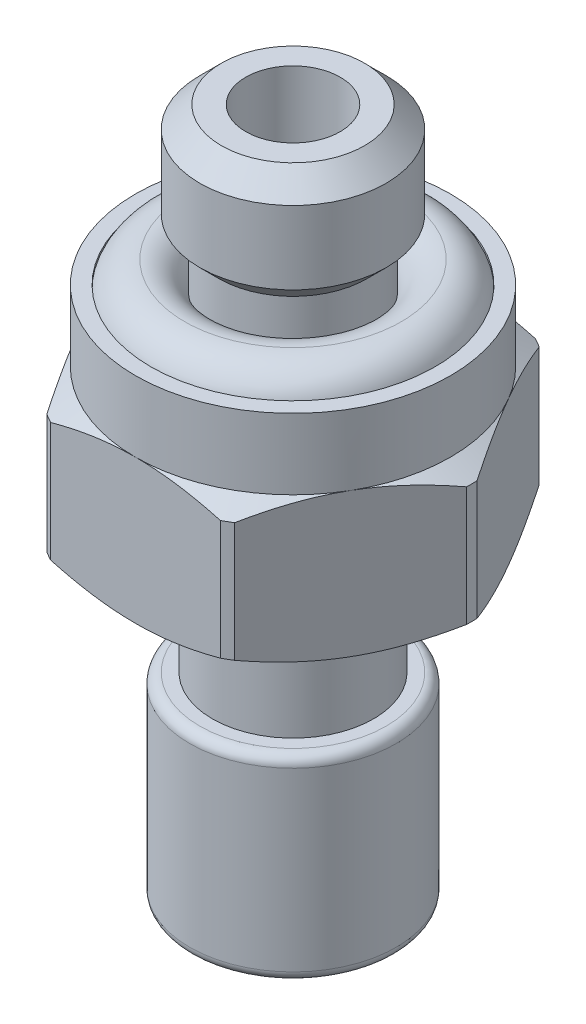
ISO-10303-21;
HEADER;
FILE_DESCRIPTION(('STEP AP214'),'2;1');
FILE_NAME('part.step','',(''),(''),'','','');
FILE_SCHEMA(('AUTOMOTIVE_DESIGN { 1 0 10303 214 1 1 1 1 }'));
ENDSEC;
DATA;
#1=APPLICATION_CONTEXT('core data for automotive mechanical design processes');
#2=APPLICATION_PROTOCOL_DEFINITION('international standard','automotive_design',2000,#1);
#3=PRODUCT_CONTEXT('',#1,'mechanical');
#4=PRODUCT('Part','Part','',(#3));
#5=PRODUCT_RELATED_PRODUCT_CATEGORY('part','',(#4));
#6=PRODUCT_DEFINITION_FORMATION('','',#4);
#7=PRODUCT_DEFINITION_CONTEXT('part definition',#1,'design');
#8=PRODUCT_DEFINITION('design','',#6,#7);
#9=PRODUCT_DEFINITION_SHAPE('','',#8);
#10=(LENGTH_UNIT() NAMED_UNIT(*) SI_UNIT(.MILLI.,.METRE.));
#11=(NAMED_UNIT(*) PLANE_ANGLE_UNIT() SI_UNIT($,.RADIAN.));
#12=(NAMED_UNIT(*) SI_UNIT($,.STERADIAN.) SOLID_ANGLE_UNIT());
#13=UNCERTAINTY_MEASURE_WITH_UNIT(LENGTH_MEASURE(1.E-05),#10,'distance_accuracy_value','');
#14=(GEOMETRIC_REPRESENTATION_CONTEXT(3) GLOBAL_UNCERTAINTY_ASSIGNED_CONTEXT((#13)) GLOBAL_UNIT_ASSIGNED_CONTEXT((#10,
#11,#12)) REPRESENTATION_CONTEXT('',''));
#15=CARTESIAN_POINT('',(0.,0.,0.));
#16=DIRECTION('',(0.,0.,1.));
#17=DIRECTION('',(1.,0.,0.));
#18=AXIS2_PLACEMENT_3D('',#15,#16,#17);
#19=CARTESIAN_POINT('',(0.,-9.03138257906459,0.));
#20=DIRECTION('',(0.,1.,0.));
#21=DIRECTION('',(0.,0.,1.));
#22=AXIS2_PLACEMENT_3D('',#19,#20,#21);
#23=CONICAL_SURFACE('',#22,4.5085,1.0471975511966);
#24=CARTESIAN_POINT('',(0.,-9.398,0.));
#25=DIRECTION('',(0.,1.,0.));
#26=DIRECTION('',(0.,0.,1.));
#27=AXIS2_PLACEMENT_3D('',#24,#25,#26);
#28=CIRCLE('',#27,3.8735);
#29=CARTESIAN_POINT('',(0.,-9.39800000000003,3.87349999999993));
#30=VERTEX_POINT('',#29);
#31=EDGE_CURVE('P0_E187',#30,#30,#28,.T.);
#32=ORIENTED_EDGE('',*,*,#31,.T.);
#33=EDGE_LOOP('',(#32));
#34=FACE_BOUND('',#33,.T.);
#35=CARTESIAN_POINT('',(0.,-9.03138257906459,0.));
#36=DIRECTION('',(0.,1.,0.));
#37=DIRECTION('',(0.,0.,1.));
#38=AXIS2_PLACEMENT_3D('',#35,#36,#37);
#39=CIRCLE('',#38,4.5085);
#40=CARTESIAN_POINT('',(4.50657042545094,-9.03138257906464,0.131891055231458));
#41=VERTEX_POINT('',#40);
#42=CARTESIAN_POINT('',(4.50657042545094,-9.03138257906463,-0.131891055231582));
#43=VERTEX_POINT('',#42);
#44=EDGE_CURVE('P0_E188',#41,#43,#39,.T.);
#45=ORIENTED_EDGE('',*,*,#44,.F.);
#46=CARTESIAN_POINT('',(4.5069354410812,-9.03118257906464,0.131258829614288));
#47=CARTESIAN_POINT('',(4.40748766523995,-9.08572502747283,0.303507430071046));
#48=CARTESIAN_POINT('',(4.30718191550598,-9.13477604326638,0.477242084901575));
#49=CARTESIAN_POINT('',(4.10494276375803,-9.21913963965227,0.827530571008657));
#50=CARTESIAN_POINT('',(4.00300651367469,-9.25442461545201,1.00408933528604));
#51=CARTESIAN_POINT('',(3.80036412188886,-9.30763773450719,1.35507625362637));
#52=CARTESIAN_POINT('',(3.69968404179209,-9.32594836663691,1.52945926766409));
#53=CARTESIAN_POINT('',(3.49800137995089,-9.3448572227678,1.87878388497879));
#54=CARTESIAN_POINT('',(3.39699925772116,-9.34547435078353,2.05372469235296));
#55=CARTESIAN_POINT('',(3.21832124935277,-9.33088433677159,2.36320408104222));
#56=CARTESIAN_POINT('',(3.14056602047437,-9.31924519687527,2.49788008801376));
#57=CARTESIAN_POINT('',(2.985580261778,-9.28610138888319,2.76632329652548));
#58=CARTESIAN_POINT('',(2.90834977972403,-9.26459583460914,2.900090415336));
#59=CARTESIAN_POINT('',(2.75321135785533,-9.2123147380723,3.16879804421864));
#60=CARTESIAN_POINT('',(2.67531765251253,-9.18137376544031,3.30371389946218));
#61=CARTESIAN_POINT('',(2.52050489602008,-9.11174981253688,3.57185745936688));
#62=CARTESIAN_POINT('',(2.44358467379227,-9.0730773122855,3.70508719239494));
#63=CARTESIAN_POINT('',(2.36714120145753,-9.0311825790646,3.8374911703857));
#64=B_SPLINE_CURVE_WITH_KNOTS('',3,(#46,#47,#48,#49,#50,#51,#52,#53,#54,#55,#56,#57,#58,#59,#60,
#61,#62,#63),.UNSPECIFIED.,.F.,.F.,(4,2,2,2,2,2,2,2,4),(0.,0.618946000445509,1.23912685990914,
1.84496677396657,2.4501593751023,2.91767373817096,3.38523010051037,3.86150778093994,
4.33714419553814),.UNSPECIFIED.);
#65=CARTESIAN_POINT('',(2.36750621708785,-9.03138257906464,3.83685894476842));
#66=VERTEX_POINT('',#65);
#67=EDGE_CURVE('P0_E807',#41,#66,#64,.T.);
#68=ORIENTED_EDGE('',*,*,#67,.T.);
#69=CARTESIAN_POINT('',(2.13906420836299,-9.03138257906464,3.96874999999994));
#70=VERTEX_POINT('',#69);
#71=EDGE_CURVE('P0_E183',#70,#66,#39,.T.);
#72=ORIENTED_EDGE('',*,*,#71,.F.);
#73=CARTESIAN_POINT('',(-6.06346107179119,-7.45040734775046,3.96874999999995));
#74=CARTESIAN_POINT('',(-5.88931565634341,-7.53450762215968,3.96874999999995));
#75=CARTESIAN_POINT('',(-5.71475696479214,-7.61776770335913,3.96874999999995));
#76=CARTESIAN_POINT('',(-5.36458950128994,-7.78212704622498,3.96874999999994));
#77=CARTESIAN_POINT('',(-5.18898055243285,-7.86322593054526,3.96874999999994));
#78=CARTESIAN_POINT('',(-4.83553370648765,-8.0232126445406,3.96874999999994));
#79=CARTESIAN_POINT('',(-4.65768879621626,-8.10208503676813,3.96874999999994));
#80=CARTESIAN_POINT('',(-4.30053222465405,-8.25642246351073,3.96874999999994));
#81=CARTESIAN_POINT('',(-4.1212206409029,-8.33188767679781,3.96874999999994));
#82=CARTESIAN_POINT('',(-3.75868278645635,-8.47937420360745,3.96874999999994));
#83=CARTESIAN_POINT('',(-3.57543533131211,-8.5513437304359,3.96874999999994));
#84=CARTESIAN_POINT('',(-3.20677418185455,-8.68961220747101,3.96874999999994));
#85=CARTESIAN_POINT('',(-3.02136024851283,-8.75591052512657,3.96874999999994));
#86=CARTESIAN_POINT('',(-2.64845653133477,-8.88104524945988,3.96874999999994));
#87=CARTESIAN_POINT('',(-2.46097216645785,-8.93989763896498,3.96874999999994));
#88=CARTESIAN_POINT('',(-2.08333879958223,-9.04822039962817,3.96874999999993));
#89=CARTESIAN_POINT('',(-1.89319066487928,-9.09769375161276,3.96874999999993));
#90=CARTESIAN_POINT('',(-1.51009438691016,-9.18484934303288,3.96874999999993));
#91=CARTESIAN_POINT('',(-1.31714534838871,-9.22252772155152,3.96874999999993));
#92=CARTESIAN_POINT('',(-0.928936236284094,-9.28354488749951,3.96874999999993));
#93=CARTESIAN_POINT('',(-0.733676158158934,-9.30688364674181,3.96874999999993));
#94=CARTESIAN_POINT('',(-0.343093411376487,-9.33715657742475,3.96874999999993));
#95=CARTESIAN_POINT('',(-0.147778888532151,-9.3441931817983,3.96874999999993));
#96=CARTESIAN_POINT('',(0.242690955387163,-9.34149398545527,3.96874999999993));
#97=CARTESIAN_POINT('',(0.437846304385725,-9.33176246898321,3.96874999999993));
#98=CARTESIAN_POINT('',(0.771530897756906,-9.30146912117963,3.96874999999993));
#99=CARTESIAN_POINT('',(0.910429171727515,-9.28475964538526,3.96874999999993));
#100=CARTESIAN_POINT('',(1.1871436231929,-9.24394061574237,3.96874999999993));
#101=CARTESIAN_POINT('',(1.32495962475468,-9.21982988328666,3.96874999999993));
#102=CARTESIAN_POINT('',(1.7366768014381,-9.13766231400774,3.96874999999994));
#103=CARTESIAN_POINT('',(2.00863754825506,-9.06979156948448,3.96874999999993));
#104=CARTESIAN_POINT('',(2.41555893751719,-8.95284851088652,3.96874999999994));
#105=CARTESIAN_POINT('',(2.55264349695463,-8.91075312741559,3.96874999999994));
#106=CARTESIAN_POINT('',(2.82538148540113,-8.82242586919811,3.96874999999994));
#107=CARTESIAN_POINT('',(2.96103583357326,-8.77619685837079,3.96874999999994));
#108=CARTESIAN_POINT('',(3.23034595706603,-8.68056198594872,3.96874999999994));
#109=CARTESIAN_POINT('',(3.36400869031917,-8.63117552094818,3.96874999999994));
#110=CARTESIAN_POINT('',(3.63029958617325,-8.52952256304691,3.96874999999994));
#111=CARTESIAN_POINT('',(3.76292730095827,-8.47725489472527,3.96874999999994));
#112=CARTESIAN_POINT('',(3.89507673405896,-8.42383156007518,3.96874999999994));
#113=B_SPLINE_CURVE_WITH_KNOTS('',3,(#73,#74,#75,#76,#77,#78,#79,#80,#81,#82,#83,#84,#85,#86,
#87,#88,#89,#90,#91,#92,#93,#94,#95,#96,#97,#98,#99,#100,#101,#102,#103,#104,#105,#106,#107,
#108,#109,#110,#111,#112),.UNSPECIFIED.,.F.,.F.,(4,2,2,2,2,2,2,2,2,2,2,2,2,2,2,2,2,2,2,4),(0.,
0.580176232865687,1.16045310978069,1.74407443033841,2.3276650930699,2.91821358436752,
3.50882785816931,4.09815204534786,4.68728861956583,5.27661783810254,5.86594821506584,
6.45156543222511,7.03703304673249,7.45652713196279,7.87608805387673,8.71583914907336,
9.14601208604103,9.57588926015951,10.0033409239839,10.4309682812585),.UNSPECIFIED.);
#114=CARTESIAN_POINT('',(-2.13906420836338,-9.03138257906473,3.96874999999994));
#115=VERTEX_POINT('',#114);
#116=EDGE_CURVE('P0_E294',#70,#115,#113,.F.);
#117=ORIENTED_EDGE('',*,*,#116,.T.);
#118=CARTESIAN_POINT('',(-2.36750621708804,-9.03138257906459,3.83685894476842));
#119=VERTEX_POINT('',#118);
#120=EDGE_CURVE('P0_E182',#119,#115,#39,.T.);
#121=ORIENTED_EDGE('',*,*,#120,.F.);
#122=CARTESIAN_POINT('',(-2.36714120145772,-9.03118257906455,3.8374911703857));
#123=CARTESIAN_POINT('',(-2.46658897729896,-9.08572502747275,3.66524256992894));
#124=CARTESIAN_POINT('',(-2.56689472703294,-9.1347760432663,3.49150791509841));
#125=CARTESIAN_POINT('',(-2.76913387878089,-9.21913963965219,3.14121942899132));
#126=CARTESIAN_POINT('',(-2.87107012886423,-9.25442461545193,2.96466066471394));
#127=CARTESIAN_POINT('',(-3.07371252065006,-9.30763773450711,2.6136737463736));
#128=CARTESIAN_POINT('',(-3.17439260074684,-9.32594836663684,2.43929073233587));
#129=CARTESIAN_POINT('',(-3.37607526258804,-9.34485722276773,2.08996611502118));
#130=CARTESIAN_POINT('',(-3.47707738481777,-9.34547435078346,1.91502530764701));
#131=CARTESIAN_POINT('',(-3.65575539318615,-9.33088433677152,1.60554591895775));
#132=CARTESIAN_POINT('',(-3.73351062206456,-9.3192451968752,1.4708699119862));
#133=CARTESIAN_POINT('',(-3.88849638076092,-9.28610138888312,1.20242670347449));
#134=CARTESIAN_POINT('',(-3.9657268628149,-9.26459583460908,1.06865958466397));
#135=CARTESIAN_POINT('',(-4.12086528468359,-9.21231473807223,0.799951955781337));
#136=CARTESIAN_POINT('',(-4.19875899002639,-9.18137376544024,0.665036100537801));
#137=CARTESIAN_POINT('',(-4.35357174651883,-9.11174981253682,0.396892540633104));
#138=CARTESIAN_POINT('',(-4.43049196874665,-9.07307731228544,0.26366280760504));
#139=CARTESIAN_POINT('',(-4.50693544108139,-9.03118257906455,0.131258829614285));
#140=B_SPLINE_CURVE_WITH_KNOTS('',3,(#122,#123,#124,#125,#126,#127,#128,#129,#130,#131,#132,
#133,#134,#135,#136,#137,#138,#139),.UNSPECIFIED.,.F.,.F.,(4,2,2,2,2,2,2,2,4),(0.,
0.618946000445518,1.23912685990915,1.84496677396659,2.45015937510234,2.91767373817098,
3.38523010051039,3.86150778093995,4.33714419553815),.UNSPECIFIED.);
#141=CARTESIAN_POINT('',(-4.50657042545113,-9.03138257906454,0.131891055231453));
#142=VERTEX_POINT('',#141);
#143=EDGE_CURVE('P0_E285',#119,#142,#140,.T.);
#144=ORIENTED_EDGE('',*,*,#143,.T.);
#145=CARTESIAN_POINT('',(-4.50657042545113,-9.03138257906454,-0.131891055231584));
#146=VERTEX_POINT('',#145);
#147=EDGE_CURVE('P0_E780',#146,#142,#39,.T.);
#148=ORIENTED_EDGE('',*,*,#147,.F.);
#149=CARTESIAN_POINT('',(-4.50693544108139,-9.03118257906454,-0.131258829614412));
#150=CARTESIAN_POINT('',(-4.40748766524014,-9.08572502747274,-0.303507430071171));
#151=CARTESIAN_POINT('',(-4.30718191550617,-9.13477604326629,-0.477242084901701));
#152=CARTESIAN_POINT('',(-4.10494276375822,-9.21913963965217,-0.827530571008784));
#153=CARTESIAN_POINT('',(-4.00300651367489,-9.25442461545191,-1.00408933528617));
#154=CARTESIAN_POINT('',(-3.80036412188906,-9.30763773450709,-1.3550762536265));
#155=CARTESIAN_POINT('',(-3.69968404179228,-9.32594836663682,-1.52945926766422));
#156=CARTESIAN_POINT('',(-3.49800137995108,-9.3448572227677,-1.87878388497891));
#157=CARTESIAN_POINT('',(-3.39699925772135,-9.34547435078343,-2.05372469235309));
#158=CARTESIAN_POINT('',(-3.21832124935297,-9.33088433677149,-2.36320408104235));
#159=CARTESIAN_POINT('',(-3.14056602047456,-9.31924519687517,-2.49788008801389));
#160=CARTESIAN_POINT('',(-2.9855802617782,-9.28610138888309,-2.76632329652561));
#161=CARTESIAN_POINT('',(-2.90834977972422,-9.26459583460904,-2.90009041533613));
#162=CARTESIAN_POINT('',(-2.75321135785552,-9.21231473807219,-3.16879804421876));
#163=CARTESIAN_POINT('',(-2.67531765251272,-9.1813737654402,-3.3037138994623));
#164=CARTESIAN_POINT('',(-2.52050489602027,-9.11174981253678,-3.571857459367));
#165=CARTESIAN_POINT('',(-2.44358467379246,-9.0730773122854,-3.70508719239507));
#166=CARTESIAN_POINT('',(-2.36714120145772,-9.0311825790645,-3.83749117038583));
#167=B_SPLINE_CURVE_WITH_KNOTS('',3,(#149,#150,#151,#152,#153,#154,#155,#156,#157,#158,#159,
#160,#161,#162,#163,#164,#165,#166),.UNSPECIFIED.,.F.,.F.,(4,2,2,2,2,2,2,2,4),(0.,
0.618946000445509,1.23912685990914,1.84496677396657,2.4501593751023,2.91767373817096,
3.38523010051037,3.86150778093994,4.33714419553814),.UNSPECIFIED.);
#168=CARTESIAN_POINT('',(-2.36750621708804,-9.03138257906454,-3.83685894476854));
#169=VERTEX_POINT('',#168);
#170=EDGE_CURVE('P0_E276',#146,#169,#167,.T.);
#171=ORIENTED_EDGE('',*,*,#170,.T.);
#172=CARTESIAN_POINT('',(-2.13906420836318,-9.03138257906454,-3.96875000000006));
#173=VERTEX_POINT('',#172);
#174=EDGE_CURVE('P0_E776',#173,#169,#39,.T.);
#175=ORIENTED_EDGE('',*,*,#174,.F.);
#176=CARTESIAN_POINT('',(-6.06346107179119,-7.4504073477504,-3.96875000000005));
#177=CARTESIAN_POINT('',(-5.88931565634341,-7.53450762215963,-3.96875000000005));
#178=CARTESIAN_POINT('',(-5.71475696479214,-7.61776770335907,-3.96875000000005));
#179=CARTESIAN_POINT('',(-5.36458950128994,-7.78212704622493,-3.96875000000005));
#180=CARTESIAN_POINT('',(-5.18898055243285,-7.86322593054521,-3.96875000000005));
#181=CARTESIAN_POINT('',(-4.83553370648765,-8.02321264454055,-3.96875000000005));
#182=CARTESIAN_POINT('',(-4.65768879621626,-8.10208503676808,-3.96875000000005));
#183=CARTESIAN_POINT('',(-4.30053222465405,-8.25642246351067,-3.96875000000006));
#184=CARTESIAN_POINT('',(-4.1212206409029,-8.33188767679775,-3.96875000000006));
#185=CARTESIAN_POINT('',(-3.75868278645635,-8.4793742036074,-3.96875000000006));
#186=CARTESIAN_POINT('',(-3.57543533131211,-8.55134373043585,-3.96875000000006));
#187=CARTESIAN_POINT('',(-3.20677418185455,-8.68961220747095,-3.96875000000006));
#188=CARTESIAN_POINT('',(-3.02136024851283,-8.75591052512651,-3.96875000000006));
#189=CARTESIAN_POINT('',(-2.64845653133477,-8.88104524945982,-3.96875000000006));
#190=CARTESIAN_POINT('',(-2.46097216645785,-8.93989763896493,-3.96875000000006));
#191=CARTESIAN_POINT('',(-2.08333879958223,-9.04822039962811,-3.96875000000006));
#192=CARTESIAN_POINT('',(-1.89319066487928,-9.0976937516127,-3.96875000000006));
#193=CARTESIAN_POINT('',(-1.51009438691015,-9.18484934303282,-3.96875000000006));
#194=CARTESIAN_POINT('',(-1.31714534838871,-9.22252772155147,-3.96875000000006));
#195=CARTESIAN_POINT('',(-0.928936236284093,-9.28354488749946,-3.96875000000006));
#196=CARTESIAN_POINT('',(-0.733676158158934,-9.30688364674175,-3.96875000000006));
#197=CARTESIAN_POINT('',(-0.343093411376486,-9.3371565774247,-3.96875000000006));
#198=CARTESIAN_POINT('',(-0.14777888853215,-9.34419318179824,-3.96875000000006));
#199=CARTESIAN_POINT('',(0.242690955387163,-9.34149398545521,-3.96875000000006));
#200=CARTESIAN_POINT('',(0.437846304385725,-9.33176246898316,-3.96875000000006));
#201=CARTESIAN_POINT('',(0.771530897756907,-9.30146912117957,-3.96875000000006));
#202=CARTESIAN_POINT('',(0.910429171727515,-9.28475964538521,-3.96875000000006));
#203=CARTESIAN_POINT('',(1.1871436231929,-9.24394061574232,-3.96875000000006));
#204=CARTESIAN_POINT('',(1.32495962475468,-9.21982988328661,-3.96875000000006));
#205=CARTESIAN_POINT('',(1.7366768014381,-9.13766231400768,-3.96875000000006));
#206=CARTESIAN_POINT('',(2.00863754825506,-9.06979156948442,-3.96875000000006));
#207=CARTESIAN_POINT('',(2.41555893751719,-8.95284851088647,-3.96875000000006));
#208=CARTESIAN_POINT('',(2.55264349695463,-8.91075312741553,-3.96875000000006));
#209=CARTESIAN_POINT('',(2.82538148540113,-8.82242586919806,-3.96875000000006));
#210=CARTESIAN_POINT('',(2.96103583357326,-8.77619685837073,-3.96875000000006));
#211=CARTESIAN_POINT('',(3.23034595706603,-8.68056198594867,-3.96875000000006));
#212=CARTESIAN_POINT('',(3.36400869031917,-8.63117552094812,-3.96875000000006));
#213=CARTESIAN_POINT('',(3.63029958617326,-8.52952256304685,-3.96875000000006));
#214=CARTESIAN_POINT('',(3.76292730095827,-8.47725489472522,-3.96875000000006));
#215=CARTESIAN_POINT('',(3.89507673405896,-8.42383156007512,-3.96875000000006));
#216=B_SPLINE_CURVE_WITH_KNOTS('',3,(#176,#177,#178,#179,#180,#181,#182,#183,#184,#185,#186,
#187,#188,#189,#190,#191,#192,#193,#194,#195,#196,#197,#198,#199,#200,#201,#202,#203,#204,#205,
#206,#207,#208,#209,#210,#211,#212,#213,#214,#215),.UNSPECIFIED.,.F.,.F.,(4,2,2,2,2,2,2,2,2,2,2,
2,2,2,2,2,2,2,2,4),(0.,0.580176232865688,1.16045310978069,1.74407443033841,2.32766509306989,
2.91821358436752,3.50882785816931,4.09815204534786,4.68728861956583,5.27661783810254,
5.86594821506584,6.45156543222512,7.03703304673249,7.45652713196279,7.87608805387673,
8.71583914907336,9.14601208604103,9.57588926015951,10.0033409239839,10.4309682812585),.UNSPECIFIED.);
#217=CARTESIAN_POINT('',(2.13906420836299,-9.03138257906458,-3.96875000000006));
#218=VERTEX_POINT('',#217);
#219=EDGE_CURVE('P0_E266',#173,#218,#216,.T.);
#220=ORIENTED_EDGE('',*,*,#219,.T.);
#221=CARTESIAN_POINT('',(2.36750621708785,-9.03138257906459,-3.83685894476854));
#222=VERTEX_POINT('',#221);
#223=EDGE_CURVE('P0_E773',#222,#218,#39,.T.);
#224=ORIENTED_EDGE('',*,*,#223,.F.);
#225=CARTESIAN_POINT('',(2.36714120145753,-9.03118257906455,-3.83749117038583));
#226=CARTESIAN_POINT('',(2.46658897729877,-9.08572502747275,-3.66524256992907));
#227=CARTESIAN_POINT('',(2.56689472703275,-9.13477604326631,-3.49150791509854));
#228=CARTESIAN_POINT('',(2.7691338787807,-9.2191396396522,-3.14121942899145));
#229=CARTESIAN_POINT('',(2.87107012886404,-9.25442461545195,-2.96466066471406));
#230=CARTESIAN_POINT('',(3.07371252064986,-9.30763773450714,-2.61367374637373));
#231=CARTESIAN_POINT('',(3.17439260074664,-9.32594836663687,-2.439290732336));
#232=CARTESIAN_POINT('',(3.37607526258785,-9.34485722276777,-2.08996611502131));
#233=CARTESIAN_POINT('',(3.47707738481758,-9.34547435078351,-1.91502530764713));
#234=CARTESIAN_POINT('',(3.65575539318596,-9.33088433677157,-1.60554591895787));
#235=CARTESIAN_POINT('',(3.73351062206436,-9.31924519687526,-1.47086991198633));
#236=CARTESIAN_POINT('',(3.88849638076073,-9.28610138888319,-1.20242670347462));
#237=CARTESIAN_POINT('',(3.9657268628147,-9.26459583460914,-1.0686595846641));
#238=CARTESIAN_POINT('',(4.1208652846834,-9.21231473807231,-0.799951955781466));
#239=CARTESIAN_POINT('',(4.1987589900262,-9.18137376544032,-0.66503610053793));
#240=CARTESIAN_POINT('',(4.35357174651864,-9.1117498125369,-0.396892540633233));
#241=CARTESIAN_POINT('',(4.43049196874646,-9.07307731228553,-0.263662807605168));
#242=CARTESIAN_POINT('',(4.5069354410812,-9.03118257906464,-0.131258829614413));
#243=B_SPLINE_CURVE_WITH_KNOTS('',3,(#225,#226,#227,#228,#229,#230,#231,#232,#233,#234,#235,
#236,#237,#238,#239,#240,#241,#242),.UNSPECIFIED.,.F.,.F.,(4,2,2,2,2,2,2,2,4),(0.,
0.618946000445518,1.23912685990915,1.84496677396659,2.45015937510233,2.91767373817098,
3.38523010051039,3.86150778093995,4.33714419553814),.UNSPECIFIED.);
#244=EDGE_CURVE('P0_E254',#222,#43,#243,.T.);
#245=ORIENTED_EDGE('',*,*,#244,.T.);
#246=EDGE_LOOP('',(#45,#68,#72,#117,#121,#144,#148,#171,#175,#220,#224,#245));
#247=FACE_BOUND('',#246,.T.);
#248=ADVANCED_FACE('P0_F16',(#34,#247),#23,.T.);
#249=CARTESIAN_POINT('',(0.,0.,0.));
#250=DIRECTION('',(0.,1.,0.));
#251=DIRECTION('',(0.,0.,1.));
#252=AXIS2_PLACEMENT_3D('',#249,#250,#251);
#253=CYLINDRICAL_SURFACE('',#252,4.5085);
#254=CARTESIAN_POINT('',(0.,-6.0266248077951,0.));
#255=DIRECTION('',(0.,1.,0.));
#256=DIRECTION('',(0.,0.,1.));
#257=AXIS2_PLACEMENT_3D('',#254,#255,#256);
#258=CIRCLE('',#257,4.5085);
#259=CARTESIAN_POINT('',(4.50657042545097,-6.02662480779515,0.131891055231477));
#260=VERTEX_POINT('',#259);
#261=CARTESIAN_POINT('',(4.50657042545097,-6.02662480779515,-0.131891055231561));
#262=VERTEX_POINT('',#261);
#263=EDGE_CURVE('P0_E146',#260,#262,#258,.T.);
#264=ORIENTED_EDGE('',*,*,#263,.F.);
#265=DIRECTION('',(0.,1.,0.));
#266=VECTOR('',#265,1.);
#267=CARTESIAN_POINT('',(4.50657042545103,0.,0.131891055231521));
#268=LINE('',#267,#266);
#269=EDGE_CURVE('P0_E798',#260,#41,#268,.F.);
#270=ORIENTED_EDGE('',*,*,#269,.T.);
#271=ORIENTED_EDGE('',*,*,#44,.T.);
#272=DIRECTION('',(0.,1.,0.));
#273=VECTOR('',#272,1.);
#274=CARTESIAN_POINT('',(4.50657042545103,0.,-0.131891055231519));
#275=LINE('',#274,#273);
#276=EDGE_CURVE('P0_E149',#43,#262,#275,.T.);
#277=ORIENTED_EDGE('',*,*,#276,.T.);
#278=EDGE_LOOP('',(#264,#270,#271,#277));
#279=FACE_BOUND('',#278,.T.);
#280=ADVANCED_FACE('P0_F234',(#279),#253,.T.);
#281=ORIENTED_EDGE('',*,*,#71,.T.);
#282=DIRECTION('',(0.,1.,0.));
#283=VECTOR('',#282,1.);
#284=CARTESIAN_POINT('',(2.36750621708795,0.,3.83685894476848));
#285=LINE('',#284,#283);
#286=CARTESIAN_POINT('',(2.36750621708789,-6.02662480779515,3.83685894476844));
#287=VERTEX_POINT('',#286);
#288=EDGE_CURVE('P0_E793',#66,#287,#285,.T.);
#289=ORIENTED_EDGE('',*,*,#288,.T.);
#290=CARTESIAN_POINT('',(2.13906420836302,-6.02662480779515,3.96874999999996));
#291=VERTEX_POINT('',#290);
#292=EDGE_CURVE('P0_E178',#291,#287,#258,.T.);
#293=ORIENTED_EDGE('',*,*,#292,.F.);
#294=DIRECTION('',(0.,1.,0.));
#295=VECTOR('',#294,1.);
#296=CARTESIAN_POINT('',(2.13906420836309,0.,3.96875));
#297=LINE('',#296,#295);
#298=EDGE_CURVE('P0_E305',#291,#70,#297,.F.);
#299=ORIENTED_EDGE('',*,*,#298,.T.);
#300=EDGE_LOOP('',(#281,#289,#293,#299));
#301=FACE_BOUND('',#300,.T.);
#302=ADVANCED_FACE('P0_F241',(#301),#253,.T.);
#303=ORIENTED_EDGE('',*,*,#120,.T.);
#304=DIRECTION('',(0.,1.,0.));
#305=VECTOR('',#304,1.);
#306=CARTESIAN_POINT('',(-2.13906420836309,0.,3.96875));
#307=LINE('',#306,#305);
#308=CARTESIAN_POINT('',(-2.13906420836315,-6.02662480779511,3.96874999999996));
#309=VERTEX_POINT('',#308);
#310=EDGE_CURVE('P0_E304',#115,#309,#307,.T.);
#311=ORIENTED_EDGE('',*,*,#310,.T.);
#312=CARTESIAN_POINT('',(-2.36750621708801,-6.0266248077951,3.83685894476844));
#313=VERTEX_POINT('',#312);
#314=EDGE_CURVE('P0_E172',#313,#309,#258,.T.);
#315=ORIENTED_EDGE('',*,*,#314,.F.);
#316=DIRECTION('',(0.,1.,0.));
#317=VECTOR('',#316,1.);
#318=CARTESIAN_POINT('',(-2.36750621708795,0.,3.83685894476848));
#319=LINE('',#318,#317);
#320=EDGE_CURVE('P0_E32',#313,#119,#319,.F.);
#321=ORIENTED_EDGE('',*,*,#320,.T.);
#322=EDGE_LOOP('',(#303,#311,#315,#321));
#323=FACE_BOUND('',#322,.T.);
#324=ADVANCED_FACE('P0_F467',(#323),#253,.T.);
#325=ORIENTED_EDGE('',*,*,#147,.T.);
#326=DIRECTION('',(0.,1.,0.));
#327=VECTOR('',#326,1.);
#328=CARTESIAN_POINT('',(-4.50657042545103,0.,0.131891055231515));
#329=LINE('',#328,#327);
#330=CARTESIAN_POINT('',(-4.5065704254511,-6.02662480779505,0.131891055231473));
#331=VERTEX_POINT('',#330);
#332=EDGE_CURVE('P0_E328',#142,#331,#329,.T.);
#333=ORIENTED_EDGE('',*,*,#332,.T.);
#334=CARTESIAN_POINT('',(-4.5065704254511,-6.02662480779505,-0.131891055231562));
#335=VERTEX_POINT('',#334);
#336=EDGE_CURVE('P0_E397',#335,#331,#258,.T.);
#337=ORIENTED_EDGE('',*,*,#336,.F.);
#338=DIRECTION('',(0.,1.,0.));
#339=VECTOR('',#338,1.);
#340=CARTESIAN_POINT('',(-4.50657042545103,0.,-0.131891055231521));
#341=LINE('',#340,#339);
#342=EDGE_CURVE('P0_E40',#335,#146,#341,.F.);
#343=ORIENTED_EDGE('',*,*,#342,.T.);
#344=EDGE_LOOP('',(#325,#333,#337,#343));
#345=FACE_BOUND('',#344,.T.);
#346=ADVANCED_FACE('P0_F480',(#345),#253,.T.);
#347=ORIENTED_EDGE('',*,*,#174,.T.);
#348=DIRECTION('',(0.,1.,0.));
#349=VECTOR('',#348,1.);
#350=CARTESIAN_POINT('',(-2.36750621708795,0.,-3.83685894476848));
#351=LINE('',#350,#349);
#352=CARTESIAN_POINT('',(-2.36750621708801,-6.02662480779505,-3.83685894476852));
#353=VERTEX_POINT('',#352);
#354=EDGE_CURVE('P0_E364',#169,#353,#351,.T.);
#355=ORIENTED_EDGE('',*,*,#354,.T.);
#356=CARTESIAN_POINT('',(-2.13906420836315,-6.02662480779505,-3.96875000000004));
#357=VERTEX_POINT('',#356);
#358=EDGE_CURVE('P0_E818',#357,#353,#258,.T.);
#359=ORIENTED_EDGE('',*,*,#358,.F.);
#360=DIRECTION('',(0.,1.,0.));
#361=VECTOR('',#360,1.);
#362=CARTESIAN_POINT('',(-2.13906420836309,0.,-3.96875));
#363=LINE('',#362,#361);
#364=EDGE_CURVE('P0_E752',#357,#173,#363,.F.);
#365=ORIENTED_EDGE('',*,*,#364,.T.);
#366=EDGE_LOOP('',(#347,#355,#359,#365));
#367=FACE_BOUND('',#366,.T.);
#368=ADVANCED_FACE('P0_F489',(#367),#253,.T.);
#369=ORIENTED_EDGE('',*,*,#223,.T.);
#370=DIRECTION('',(0.,1.,0.));
#371=VECTOR('',#370,1.);
#372=CARTESIAN_POINT('',(2.13906420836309,0.,-3.96875));
#373=LINE('',#372,#371);
#374=CARTESIAN_POINT('',(2.13906420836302,-6.02662480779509,-3.96875000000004));
#375=VERTEX_POINT('',#374);
#376=EDGE_CURVE('P0_E758',#218,#375,#373,.T.);
#377=ORIENTED_EDGE('',*,*,#376,.T.);
#378=CARTESIAN_POINT('',(2.36750621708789,-6.0266248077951,-3.83685894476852));
#379=VERTEX_POINT('',#378);
#380=EDGE_CURVE('P0_E821',#379,#375,#258,.T.);
#381=ORIENTED_EDGE('',*,*,#380,.F.);
#382=DIRECTION('',(0.,1.,0.));
#383=VECTOR('',#382,1.);
#384=CARTESIAN_POINT('',(2.36750621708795,0.,-3.83685894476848));
#385=LINE('',#384,#383);
#386=EDGE_CURVE('P0_E129',#379,#222,#385,.F.);
#387=ORIENTED_EDGE('',*,*,#386,.T.);
#388=EDGE_LOOP('',(#369,#377,#381,#387));
#389=FACE_BOUND('',#388,.T.);
#390=ADVANCED_FACE('P0_F244',(#389),#253,.T.);
#391=CARTESIAN_POINT('',(0.,-5.715,0.));
#392=DIRECTION('',(0.,-1.,0.));
#393=DIRECTION('',(0.,0.,-1.));
#394=AXIS2_PLACEMENT_3D('',#391,#392,#393);
#395=CONICAL_SURFACE('',#394,3.96875,1.0471975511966);
#396=ORIENTED_EDGE('',*,*,#292,.T.);
#397=CARTESIAN_POINT('',(2.36714120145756,-6.02682480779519,3.83749117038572));
#398=CARTESIAN_POINT('',(2.46658897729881,-5.97228235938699,3.66524256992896));
#399=CARTESIAN_POINT('',(2.56689472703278,-5.92323134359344,3.49150791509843));
#400=CARTESIAN_POINT('',(2.76913387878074,-5.83886774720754,3.14121942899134));
#401=CARTESIAN_POINT('',(2.87107012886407,-5.80358277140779,2.96466066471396));
#402=CARTESIAN_POINT('',(3.0737125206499,-5.75036965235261,2.61367374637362));
#403=CARTESIAN_POINT('',(3.17439260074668,-5.73205902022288,2.43929073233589));
#404=CARTESIAN_POINT('',(3.37607526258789,-5.71315016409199,2.0899661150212));
#405=CARTESIAN_POINT('',(3.47707738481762,-5.71253303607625,1.91502530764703));
#406=CARTESIAN_POINT('',(3.655755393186,-5.72712305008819,1.60554591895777));
#407=CARTESIAN_POINT('',(3.7335106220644,-5.73876218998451,1.47086991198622));
#408=CARTESIAN_POINT('',(3.88849638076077,-5.77190599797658,1.20242670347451));
#409=CARTESIAN_POINT('',(3.96572686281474,-5.79341155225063,1.06865958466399));
#410=CARTESIAN_POINT('',(4.12086528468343,-5.84569264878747,0.799951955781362));
#411=CARTESIAN_POINT('',(4.19875899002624,-5.87663362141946,0.665036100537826));
#412=CARTESIAN_POINT('',(4.35357174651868,-5.94625757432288,0.39689254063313));
#413=CARTESIAN_POINT('',(4.43049196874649,-5.98493007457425,0.263662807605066));
#414=CARTESIAN_POINT('',(4.50693544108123,-6.02682480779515,0.131258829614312));
#415=B_SPLINE_CURVE_WITH_KNOTS('',3,(#397,#398,#399,#400,#401,#402,#403,#404,#405,#406,#407,
#408,#409,#410,#411,#412,#413,#414),.UNSPECIFIED.,.F.,.F.,(4,2,2,2,2,2,2,2,4),(0.,
0.618946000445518,1.23912685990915,1.84496677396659,2.45015937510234,2.91767373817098,
3.38523010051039,3.86150778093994,4.33714419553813),.UNSPECIFIED.);
#416=CARTESIAN_POINT('',(3.43703832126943,-5.71500000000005,1.98437499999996));
#417=VERTEX_POINT('',#416);
#418=EDGE_CURVE('P0_E795',#287,#417,#415,.T.);
#419=ORIENTED_EDGE('',*,*,#418,.T.);
#420=CARTESIAN_POINT('',(0.,-5.715,0.));
#421=DIRECTION('',(0.,1.,0.));
#422=DIRECTION('',(0.,0.,1.));
#423=AXIS2_PLACEMENT_3D('',#420,#421,#422);
#424=CIRCLE('',#423,3.96875);
#425=CARTESIAN_POINT('',(0.,-5.71500000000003,3.96874999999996));
#426=VERTEX_POINT('',#425);
#427=EDGE_CURVE('P0_E165',#426,#417,#424,.T.);
#428=ORIENTED_EDGE('',*,*,#427,.F.);
#429=CARTESIAN_POINT('',(-6.07108013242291,-7.61128128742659,3.96874999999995));
#430=CARTESIAN_POINT('',(-5.89687574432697,-7.52712079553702,3.96874999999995));
#431=CARTESIAN_POINT('',(-5.72225880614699,-7.44379875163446,3.96874999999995));
#432=CARTESIAN_POINT('',(-5.37197673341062,-7.27931081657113,3.96874999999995));
#433=CARTESIAN_POINT('',(-5.19631142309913,-7.19814530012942,3.96874999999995));
#434=CARTESIAN_POINT('',(-4.84275764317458,-7.03802079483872,3.96874999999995));
#435=CARTESIAN_POINT('',(-4.66486220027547,-6.95907714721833,3.96874999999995));
#436=CARTESIAN_POINT('',(-4.30760697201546,-6.80458924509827,3.96874999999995));
#437=CARTESIAN_POINT('',(-4.12824726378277,-6.72904481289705,3.96874999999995));
#438=CARTESIAN_POINT('',(-3.76557930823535,-6.58137396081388,3.96874999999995));
#439=CARTESIAN_POINT('',(-3.58224955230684,-6.50930007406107,3.96874999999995));
#440=CARTESIAN_POINT('',(-3.21342553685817,-6.37081196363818,3.96874999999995));
#441=CARTESIAN_POINT('',(-3.02793103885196,-6.30439837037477,3.96874999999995));
#442=CARTESIAN_POINT('',(-2.65486540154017,-6.17901970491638,3.96874999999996));
#443=CARTESIAN_POINT('',(-2.46729965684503,-6.12003874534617,3.96874999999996));
#444=CARTESIAN_POINT('',(-2.08950197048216,-6.01144470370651,3.96874999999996));
#445=CARTESIAN_POINT('',(-1.89927089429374,-5.9618286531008,3.96874999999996));
#446=CARTESIAN_POINT('',(-1.51601019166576,-5.87437635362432,3.96874999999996));
#447=CARTESIAN_POINT('',(-1.32297976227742,-5.83654355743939,3.96874999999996));
#448=CARTESIAN_POINT('',(-0.934598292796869,-5.77521014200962,3.96874999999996));
#449=CARTESIAN_POINT('',(-0.73924724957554,-5.75170954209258,3.96874999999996));
#450=CARTESIAN_POINT('',(-0.348479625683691,-5.72111965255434,3.96874999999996));
#451=CARTESIAN_POINT('',(-0.153071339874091,-5.71392708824,3.96874999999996));
#452=CARTESIAN_POINT('',(0.237598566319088,-5.71633275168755,3.96874999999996));
#453=CARTESIAN_POINT('',(0.432860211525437,-5.72592665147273,3.96874999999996));
#454=CARTESIAN_POINT('',(0.766485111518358,-5.7559865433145,3.96874999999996));
#455=CARTESIAN_POINT('',(0.90521683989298,-5.77257849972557,3.96874999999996));
#456=CARTESIAN_POINT('',(1.18160463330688,-5.81315391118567,3.96874999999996));
#457=CARTESIAN_POINT('',(1.31926052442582,-5.83713853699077,3.96874999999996));
#458=CARTESIAN_POINT('',(1.73050437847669,-5.91892216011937,3.96874999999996));
#459=CARTESIAN_POINT('',(2.00216007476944,-5.98652971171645,3.96874999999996));
#460=CARTESIAN_POINT('',(2.40863993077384,-6.10308390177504,3.96874999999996));
#461=CARTESIAN_POINT('',(2.54558411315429,-6.14505127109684,3.96874999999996));
#462=CARTESIAN_POINT('',(2.81804299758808,-6.23312607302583,3.96874999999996));
#463=CARTESIAN_POINT('',(2.95355861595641,-6.27923064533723,3.96874999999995));
#464=CARTESIAN_POINT('',(3.22259360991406,-6.37462150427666,3.96874999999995));
#465=CARTESIAN_POINT('',(3.35611993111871,-6.42388839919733,3.96874999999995));
#466=CARTESIAN_POINT('',(3.62213766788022,-6.52530570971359,3.96874999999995));
#467=CARTESIAN_POINT('',(3.75462863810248,-6.5774572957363,3.96874999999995));
#468=CARTESIAN_POINT('',(3.88664110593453,-6.63076629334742,3.96874999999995));
#469=B_SPLINE_CURVE_WITH_KNOTS('',3,(#429,#430,#431,#432,#433,#434,#435,#436,#437,#438,#439,
#440,#441,#442,#443,#444,#445,#446,#447,#448,#449,#450,#451,#452,#453,#454,#455,#456,#457,#458,
#459,#460,#461,#462,#463,#464,#465,#466,#467,#468),.UNSPECIFIED.,.F.,.F.,(4,2,2,2,2,2,2,2,2,2,2,
2,2,2,2,2,2,2,2,4),(0.,0.580414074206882,1.16092835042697,1.7447750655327,2.32859122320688,
2.9194843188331,3.51044313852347,4.10011653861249,4.68960270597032,5.27926144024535,
5.86892096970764,6.45483577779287,7.04059954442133,7.4595559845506,7.87857880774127,
8.7172501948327,9.14690769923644,9.57627041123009,10.0032138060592,10.4303317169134),.UNSPECIFIED.);
#470=EDGE_CURVE('P0_E319',#426,#291,#469,.T.);
#471=ORIENTED_EDGE('',*,*,#470,.T.);
#472=EDGE_LOOP('',(#396,#419,#428,#471));
#473=FACE_BOUND('',#472,.T.);
#474=ADVANCED_FACE('P0_F329',(#473),#395,.T.);
#475=CARTESIAN_POINT('',(3.43703832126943,-5.71500000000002,-1.98437500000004));
#476=VERTEX_POINT('',#475);
#477=EDGE_CURVE('P0_E143',#417,#476,#424,.T.);
#478=ORIENTED_EDGE('',*,*,#477,.F.);
#479=EDGE_CURVE('P0_E796',#417,#260,#415,.T.);
#480=ORIENTED_EDGE('',*,*,#479,.T.);
#481=ORIENTED_EDGE('',*,*,#263,.T.);
#482=CARTESIAN_POINT('',(4.50693544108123,-6.02682480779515,-0.131258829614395));
#483=CARTESIAN_POINT('',(4.40748766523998,-5.97228235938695,-0.303507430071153));
#484=CARTESIAN_POINT('',(4.30718191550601,-5.9232313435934,-0.477242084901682));
#485=CARTESIAN_POINT('',(4.10494276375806,-5.83886774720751,-0.827530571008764));
#486=CARTESIAN_POINT('',(4.00300651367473,-5.80358277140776,-1.00408933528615));
#487=CARTESIAN_POINT('',(3.8003641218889,-5.75036965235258,-1.35507625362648));
#488=CARTESIAN_POINT('',(3.69968404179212,-5.73205902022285,-1.5294592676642));
#489=CARTESIAN_POINT('',(3.49800137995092,-5.71315016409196,-1.87878388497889));
#490=CARTESIAN_POINT('',(3.39699925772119,-5.71253303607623,-2.05372469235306));
#491=CARTESIAN_POINT('',(3.21832124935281,-5.72712305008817,-2.36320408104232));
#492=CARTESIAN_POINT('',(3.1405660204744,-5.73876218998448,-2.49788008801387));
#493=CARTESIAN_POINT('',(2.98558026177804,-5.77190599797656,-2.76632329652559));
#494=CARTESIAN_POINT('',(2.90834977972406,-5.79341155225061,-2.90009041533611));
#495=CARTESIAN_POINT('',(2.75321135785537,-5.84569264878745,-3.16879804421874));
#496=CARTESIAN_POINT('',(2.67531765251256,-5.87663362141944,-3.30371389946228));
#497=CARTESIAN_POINT('',(2.52050489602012,-5.94625757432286,-3.57185745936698));
#498=CARTESIAN_POINT('',(2.4435846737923,-5.98493007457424,-3.70508719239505));
#499=CARTESIAN_POINT('',(2.36714120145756,-6.02682480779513,-3.8374911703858));
#500=B_SPLINE_CURVE_WITH_KNOTS('',3,(#482,#483,#484,#485,#486,#487,#488,#489,#490,#491,#492,
#493,#494,#495,#496,#497,#498,#499),.UNSPECIFIED.,.F.,.F.,(4,2,2,2,2,2,2,2,4),(0.,
0.618946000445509,1.23912685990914,1.84496677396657,2.4501593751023,2.91767373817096,
3.38523010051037,3.86150778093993,4.33714419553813),.UNSPECIFIED.);
#501=EDGE_CURVE('P0_E126',#262,#476,#500,.T.);
#502=ORIENTED_EDGE('',*,*,#501,.T.);
#503=EDGE_LOOP('',(#478,#480,#481,#502));
#504=FACE_BOUND('',#503,.T.);
#505=ADVANCED_FACE('P0_F140',(#504),#395,.T.);
#506=ORIENTED_EDGE('',*,*,#314,.T.);
#507=EDGE_CURVE('P0_E327',#309,#426,#469,.T.);
#508=ORIENTED_EDGE('',*,*,#507,.T.);
#509=CARTESIAN_POINT('',(-3.43703832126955,-5.71499999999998,1.98437499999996));
#510=VERTEX_POINT('',#509);
#511=EDGE_CURVE('P0_E173',#510,#426,#424,.T.);
#512=ORIENTED_EDGE('',*,*,#511,.F.);
#513=CARTESIAN_POINT('',(-4.50693544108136,-6.02682480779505,0.131258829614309));
#514=CARTESIAN_POINT('',(-4.40748766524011,-5.97228235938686,0.303507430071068));
#515=CARTESIAN_POINT('',(-4.30718191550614,-5.92323134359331,0.477242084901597));
#516=CARTESIAN_POINT('',(-4.10494276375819,-5.83886774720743,0.827530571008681));
#517=CARTESIAN_POINT('',(-4.00300651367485,-5.80358277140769,1.00408933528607));
#518=CARTESIAN_POINT('',(-3.80036412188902,-5.75036965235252,1.3550762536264));
#519=CARTESIAN_POINT('',(-3.69968404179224,-5.73205902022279,1.52945926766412));
#520=CARTESIAN_POINT('',(-3.49800137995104,-5.71315016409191,1.87878388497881));
#521=CARTESIAN_POINT('',(-3.39699925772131,-5.71253303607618,2.05372469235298));
#522=CARTESIAN_POINT('',(-3.21832124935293,-5.72712305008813,2.36320408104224));
#523=CARTESIAN_POINT('',(-3.14056602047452,-5.73876218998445,2.49788008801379));
#524=CARTESIAN_POINT('',(-2.98558026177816,-5.77190599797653,2.7663232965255));
#525=CARTESIAN_POINT('',(-2.90834977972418,-5.79341155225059,2.90009041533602));
#526=CARTESIAN_POINT('',(-2.75321135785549,-5.84569264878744,3.16879804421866));
#527=CARTESIAN_POINT('',(-2.67531765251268,-5.87663362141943,3.3037138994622));
#528=CARTESIAN_POINT('',(-2.52050489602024,-5.94625757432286,3.5718574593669));
#529=CARTESIAN_POINT('',(-2.44358467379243,-5.98493007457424,3.70508719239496));
#530=CARTESIAN_POINT('',(-2.36714120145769,-6.02682480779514,3.83749117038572));
#531=B_SPLINE_CURVE_WITH_KNOTS('',3,(#513,#514,#515,#516,#517,#518,#519,#520,#521,#522,#523,
#524,#525,#526,#527,#528,#529,#530),.UNSPECIFIED.,.F.,.F.,(4,2,2,2,2,2,2,2,4),(0.,
0.61894600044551,1.23912685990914,1.84496677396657,2.4501593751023,2.91767373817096,
3.38523010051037,3.86150778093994,4.33714419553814),.UNSPECIFIED.);
#532=EDGE_CURVE('P0_E357',#510,#313,#531,.T.);
#533=ORIENTED_EDGE('',*,*,#532,.T.);
#534=EDGE_LOOP('',(#506,#508,#512,#533));
#535=FACE_BOUND('',#534,.T.);
#536=ADVANCED_FACE('P0_F401',(#535),#395,.T.);
#537=ORIENTED_EDGE('',*,*,#336,.T.);
#538=EDGE_CURVE('P0_E326',#331,#510,#531,.T.);
#539=ORIENTED_EDGE('',*,*,#538,.T.);
#540=CARTESIAN_POINT('',(-3.43703832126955,-5.71499999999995,-1.98437500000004));
#541=VERTEX_POINT('',#540);
#542=EDGE_CURVE('P0_E396',#541,#510,#424,.T.);
#543=ORIENTED_EDGE('',*,*,#542,.F.);
#544=CARTESIAN_POINT('',(-2.36714120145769,-6.02682480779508,-3.8374911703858));
#545=CARTESIAN_POINT('',(-2.46658897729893,-5.97228235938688,-3.66524256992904));
#546=CARTESIAN_POINT('',(-2.5668947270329,-5.92323134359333,-3.49150791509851));
#547=CARTESIAN_POINT('',(-2.76913387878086,-5.83886774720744,-3.14121942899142));
#548=CARTESIAN_POINT('',(-2.87107012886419,-5.80358277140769,-2.96466066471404));
#549=CARTESIAN_POINT('',(-3.07371252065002,-5.75036965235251,-2.6136737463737));
#550=CARTESIAN_POINT('',(-3.1743926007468,-5.73205902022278,-2.43929073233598));
#551=CARTESIAN_POINT('',(-3.376075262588,-5.71315016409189,-2.08996611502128));
#552=CARTESIAN_POINT('',(-3.47707738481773,-5.71253303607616,-1.91502530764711));
#553=CARTESIAN_POINT('',(-3.65575539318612,-5.7271230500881,-1.60554591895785));
#554=CARTESIAN_POINT('',(-3.73351062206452,-5.73876218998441,-1.47086991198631));
#555=CARTESIAN_POINT('',(-3.88849638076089,-5.77190599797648,-1.20242670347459));
#556=CARTESIAN_POINT('',(-3.96572686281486,-5.79341155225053,-1.06865958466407));
#557=CARTESIAN_POINT('',(-4.12086528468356,-5.84569264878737,-0.799951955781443));
#558=CARTESIAN_POINT('',(-4.19875899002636,-5.87663362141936,-0.665036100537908));
#559=CARTESIAN_POINT('',(-4.3535717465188,-5.94625757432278,-0.396892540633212));
#560=CARTESIAN_POINT('',(-4.43049196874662,-5.98493007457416,-0.263662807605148));
#561=CARTESIAN_POINT('',(-4.50693544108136,-6.02682480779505,-0.131258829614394));
#562=B_SPLINE_CURVE_WITH_KNOTS('',3,(#544,#545,#546,#547,#548,#549,#550,#551,#552,#553,#554,
#555,#556,#557,#558,#559,#560,#561),.UNSPECIFIED.,.F.,.F.,(4,2,2,2,2,2,2,2,4),(0.,
0.618946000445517,1.23912685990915,1.84496677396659,2.45015937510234,2.91767373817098,
3.38523010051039,3.86150778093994,4.33714419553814),.UNSPECIFIED.);
#563=EDGE_CURVE('P0_E351',#541,#335,#562,.T.);
#564=ORIENTED_EDGE('',*,*,#563,.T.);
#565=EDGE_LOOP('',(#537,#539,#543,#564));
#566=FACE_BOUND('',#565,.T.);
#567=ADVANCED_FACE('P0_F394',(#566),#395,.T.);
#568=ORIENTED_EDGE('',*,*,#358,.T.);
#569=EDGE_CURVE('P0_E363',#353,#541,#562,.T.);
#570=ORIENTED_EDGE('',*,*,#569,.T.);
#571=CARTESIAN_POINT('',(0.,-5.71499999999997,-3.96875000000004));
#572=VERTEX_POINT('',#571);
#573=EDGE_CURVE('P0_E159',#572,#541,#424,.T.);
#574=ORIENTED_EDGE('',*,*,#573,.F.);
#575=CARTESIAN_POINT('',(-6.07108013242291,-7.61128128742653,-3.96875000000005));
#576=CARTESIAN_POINT('',(-5.89687574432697,-7.52712079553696,-3.96875000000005));
#577=CARTESIAN_POINT('',(-5.72225880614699,-7.4437987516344,-3.96875000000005));
#578=CARTESIAN_POINT('',(-5.37197673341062,-7.27931081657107,-3.96875000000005));
#579=CARTESIAN_POINT('',(-5.19631142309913,-7.19814530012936,-3.96875000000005));
#580=CARTESIAN_POINT('',(-4.84275764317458,-7.03802079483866,-3.96875000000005));
#581=CARTESIAN_POINT('',(-4.66486220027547,-6.95907714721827,-3.96875000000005));
#582=CARTESIAN_POINT('',(-4.30760697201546,-6.80458924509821,-3.96875000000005));
#583=CARTESIAN_POINT('',(-4.12824726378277,-6.72904481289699,-3.96875000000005));
#584=CARTESIAN_POINT('',(-3.76557930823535,-6.58137396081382,-3.96875000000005));
#585=CARTESIAN_POINT('',(-3.58224955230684,-6.50930007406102,-3.96875000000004));
#586=CARTESIAN_POINT('',(-3.21342553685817,-6.37081196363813,-3.96875000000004));
#587=CARTESIAN_POINT('',(-3.02793103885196,-6.30439837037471,-3.96875000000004));
#588=CARTESIAN_POINT('',(-2.65486540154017,-6.17901970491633,-3.96875000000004));
#589=CARTESIAN_POINT('',(-2.46729965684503,-6.12003874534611,-3.96875000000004));
#590=CARTESIAN_POINT('',(-2.08950197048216,-6.01144470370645,-3.96875000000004));
#591=CARTESIAN_POINT('',(-1.89927089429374,-5.96182865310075,-3.96875000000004));
#592=CARTESIAN_POINT('',(-1.51601019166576,-5.87437635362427,-3.96875000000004));
#593=CARTESIAN_POINT('',(-1.32297976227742,-5.83654355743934,-3.96875000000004));
#594=CARTESIAN_POINT('',(-0.93459829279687,-5.77521014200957,-3.96875000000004));
#595=CARTESIAN_POINT('',(-0.73924724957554,-5.75170954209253,-3.96875000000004));
#596=CARTESIAN_POINT('',(-0.348479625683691,-5.72111965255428,-3.96875000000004));
#597=CARTESIAN_POINT('',(-0.153071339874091,-5.71392708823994,-3.96875000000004));
#598=CARTESIAN_POINT('',(0.237598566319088,-5.71633275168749,-3.96875000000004));
#599=CARTESIAN_POINT('',(0.432860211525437,-5.72592665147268,-3.96875000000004));
#600=CARTESIAN_POINT('',(0.766485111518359,-5.75598654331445,-3.96875000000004));
#601=CARTESIAN_POINT('',(0.905216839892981,-5.77257849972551,-3.96875000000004));
#602=CARTESIAN_POINT('',(1.18160463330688,-5.81315391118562,-3.96875000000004));
#603=CARTESIAN_POINT('',(1.31926052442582,-5.83713853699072,-3.96875000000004));
#604=CARTESIAN_POINT('',(1.73050437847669,-5.91892216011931,-3.96875000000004));
#605=CARTESIAN_POINT('',(2.00216007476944,-5.9865297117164,-3.96875000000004));
#606=CARTESIAN_POINT('',(2.40863993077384,-6.10308390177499,-3.96875000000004));
#607=CARTESIAN_POINT('',(2.54558411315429,-6.14505127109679,-3.96875000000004));
#608=CARTESIAN_POINT('',(2.81804299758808,-6.23312607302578,-3.96875000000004));
#609=CARTESIAN_POINT('',(2.95355861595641,-6.27923064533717,-3.96875000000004));
#610=CARTESIAN_POINT('',(3.22259360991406,-6.3746215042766,-3.96875000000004));
#611=CARTESIAN_POINT('',(3.35611993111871,-6.42388839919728,-3.96875000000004));
#612=CARTESIAN_POINT('',(3.62213766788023,-6.52530570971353,-3.96875000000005));
#613=CARTESIAN_POINT('',(3.75462863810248,-6.57745729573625,-3.96875000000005));
#614=CARTESIAN_POINT('',(3.88664110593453,-6.63076629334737,-3.96875000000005));
#615=B_SPLINE_CURVE_WITH_KNOTS('',3,(#575,#576,#577,#578,#579,#580,#581,#582,#583,#584,#585,
#586,#587,#588,#589,#590,#591,#592,#593,#594,#595,#596,#597,#598,#599,#600,#601,#602,#603,#604,
#605,#606,#607,#608,#609,#610,#611,#612,#613,#614),.UNSPECIFIED.,.F.,.F.,(4,2,2,2,2,2,2,2,2,2,2,
2,2,2,2,2,2,2,2,4),(0.,0.580414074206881,1.16092835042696,1.7447750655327,2.32859122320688,
2.91948431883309,3.51044313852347,4.10011653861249,4.68960270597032,5.27926144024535,
5.86892096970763,6.45483577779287,7.04059954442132,7.4595559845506,7.87857880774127,
8.7172501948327,9.14690769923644,9.57627041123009,10.0032138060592,10.4303317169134),.UNSPECIFIED.);
#616=EDGE_CURVE('P0_E148',#572,#357,#615,.F.);
#617=ORIENTED_EDGE('',*,*,#616,.T.);
#618=EDGE_LOOP('',(#568,#570,#574,#617));
#619=FACE_BOUND('',#618,.T.);
#620=ADVANCED_FACE('P0_F418',(#619),#395,.T.);
#621=ORIENTED_EDGE('',*,*,#380,.T.);
#622=EDGE_CURVE('P0_E154',#375,#572,#615,.F.);
#623=ORIENTED_EDGE('',*,*,#622,.T.);
#624=EDGE_CURVE('P0_E152',#476,#572,#424,.T.);
#625=ORIENTED_EDGE('',*,*,#624,.F.);
#626=EDGE_CURVE('P0_E123',#476,#379,#500,.T.);
#627=ORIENTED_EDGE('',*,*,#626,.T.);
#628=EDGE_LOOP('',(#621,#623,#625,#627));
#629=FACE_BOUND('',#628,.T.);
#630=ADVANCED_FACE('P0_F153',(#629),#395,.T.);
#631=CARTESIAN_POINT('',(1.8034,0.,0.));
#632=DIRECTION('',(0.,1.,0.));
#633=DIRECTION('',(0.,0.,1.));
#634=AXIS2_PLACEMENT_3D('',#631,#632,#633);
#635=PLANE('',#634);
#636=CARTESIAN_POINT('',(0.,0.,0.));
#637=DIRECTION('',(0.,1.,0.));
#638=DIRECTION('',(0.,0.,1.));
#639=AXIS2_PLACEMENT_3D('',#636,#637,#638);
#640=CIRCLE('',#639,1.19062499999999);
#641=CARTESIAN_POINT('',(0.,0.,1.19062499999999));
#642=VERTEX_POINT('',#641);
#643=EDGE_CURVE('P0_E930',#642,#642,#640,.T.);
#644=ORIENTED_EDGE('',*,*,#643,.F.);
#645=EDGE_LOOP('',(#644));
#646=FACE_BOUND('',#645,.T.);
#647=CARTESIAN_POINT('',(0.,0.,0.));
#648=DIRECTION('',(0.,1.,0.));
#649=DIRECTION('',(0.,0.,1.));
#650=AXIS2_PLACEMENT_3D('',#647,#648,#649);
#651=CIRCLE('',#650,1.8034);
#652=CARTESIAN_POINT('',(0.,0.,1.8034));
#653=VERTEX_POINT('',#652);
#654=EDGE_CURVE('P0_E905',#653,#653,#651,.T.);
#655=ORIENTED_EDGE('',*,*,#654,.T.);
#656=EDGE_LOOP('',(#655));
#657=FACE_BOUND('',#656,.T.);
#658=ADVANCED_FACE('P0_F18',(#646,#657),#635,.T.);
#659=CARTESIAN_POINT('',(-1.81712749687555E-13,-17.3482,-1.21141833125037E-13));
#660=DIRECTION('',(0.,-1.,0.));
#661=DIRECTION('',(0.,0.,-1.));
#662=AXIS2_PLACEMENT_3D('',#659,#660,#661);
#663=PLANE('',#662);
#664=CARTESIAN_POINT('',(-1.81712749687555E-13,-17.3482,-1.21141833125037E-13));
#665=DIRECTION('',(0.,1.,0.));
#666=DIRECTION('',(0.,0.,1.));
#667=AXIS2_PLACEMENT_3D('',#664,#665,#666);
#668=CIRCLE('',#667,1.190625);
#669=CARTESIAN_POINT('',(-1.81712749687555E-13,-17.3482,1.19062499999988));
#670=VERTEX_POINT('',#669);
#671=EDGE_CURVE('P0_E413',#670,#670,#668,.T.);
#672=ORIENTED_EDGE('',*,*,#671,.T.);
#673=EDGE_LOOP('',(#672));
#674=FACE_BOUND('',#673,.T.);
#675=CARTESIAN_POINT('',(-1.81712749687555E-13,-17.3482,-1.21141833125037E-13));
#676=DIRECTION('',(0.,1.,0.));
#677=DIRECTION('',(0.,0.,1.));
#678=AXIS2_PLACEMENT_3D('',#675,#676,#677);
#679=CIRCLE('',#678,2.3495);
#680=CARTESIAN_POINT('',(-1.81712749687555E-13,-17.3482,2.34949999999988));
#681=VERTEX_POINT('',#680);
#682=EDGE_CURVE('P0_E10',#681,#681,#679,.T.);
#683=ORIENTED_EDGE('',*,*,#682,.F.);
#684=EDGE_LOOP('',(#683));
#685=FACE_BOUND('',#684,.T.);
#686=ADVANCED_FACE('P0_F221',(#674,#685),#663,.T.);
#687=CARTESIAN_POINT('',(-1.79052240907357E-13,-17.0942,-1.19368160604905E-13));
#688=DIRECTION('',(0.,1.,0.));
#689=DIRECTION('',(0.,0.,1.));
#690=AXIS2_PLACEMENT_3D('',#687,#688,#689);
#691=TOROIDAL_SURFACE('',#690,2.3495,0.254);
#692=ORIENTED_EDGE('',*,*,#682,.T.);
#693=EDGE_LOOP('',(#692));
#694=FACE_BOUND('',#693,.T.);
#695=CARTESIAN_POINT('',(-1.79052240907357E-13,-17.0942,-1.19368160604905E-13));
#696=DIRECTION('',(0.,1.,0.));
#697=DIRECTION('',(0.,0.,1.));
#698=AXIS2_PLACEMENT_3D('',#695,#696,#697);
#699=CIRCLE('',#698,2.6035);
#700=CARTESIAN_POINT('',(-1.79052240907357E-13,-17.0942,2.60349999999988));
#701=VERTEX_POINT('',#700);
#702=EDGE_CURVE('P0_E25',#701,#701,#699,.T.);
#703=ORIENTED_EDGE('',*,*,#702,.F.);
#704=EDGE_LOOP('',(#703));
#705=FACE_BOUND('',#704,.T.);
#706=ADVANCED_FACE('P0_F219',(#694,#705),#691,.T.);
#707=CARTESIAN_POINT('',(0.,0.,0.));
#708=DIRECTION('',(0.,1.,0.));
#709=DIRECTION('',(0.,0.,1.));
#710=AXIS2_PLACEMENT_3D('',#707,#708,#709);
#711=CYLINDRICAL_SURFACE('',#710,2.6035);
#712=ORIENTED_EDGE('',*,*,#702,.T.);
#713=EDGE_LOOP('',(#712));
#714=FACE_BOUND('',#713,.T.);
#715=CARTESIAN_POINT('',(-1.32493337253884E-13,-12.6492,0.));
#716=DIRECTION('',(0.,1.,0.));
#717=DIRECTION('',(0.,0.,1.));
#718=AXIS2_PLACEMENT_3D('',#715,#716,#717);
#719=CIRCLE('',#718,2.6035);
#720=CARTESIAN_POINT('',(-1.32493337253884E-13,-12.6492,2.60349999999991));
#721=VERTEX_POINT('',#720);
#722=EDGE_CURVE('P0_E208',#721,#721,#719,.T.);
#723=ORIENTED_EDGE('',*,*,#722,.F.);
#724=EDGE_LOOP('',(#723));
#725=FACE_BOUND('',#724,.T.);
#726=ADVANCED_FACE('P0_F216',(#714,#725),#711,.T.);
#727=CARTESIAN_POINT('',(-1.32493337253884E-13,-12.6492,0.));
#728=DIRECTION('',(0.,1.,0.));
#729=DIRECTION('',(0.,0.,1.));
#730=AXIS2_PLACEMENT_3D('',#727,#728,#729);
#731=TOROIDAL_SURFACE('',#730,2.3495,0.254);
#732=ORIENTED_EDGE('',*,*,#722,.T.);
#733=EDGE_LOOP('',(#732));
#734=FACE_BOUND('',#733,.T.);
#735=CARTESIAN_POINT('',(-1.29832828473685E-13,-12.3952,0.));
#736=DIRECTION('',(0.,1.,0.));
#737=DIRECTION('',(0.,0.,1.));
#738=AXIS2_PLACEMENT_3D('',#735,#736,#737);
#739=CIRCLE('',#738,2.3495);
#740=CARTESIAN_POINT('',(-1.29832828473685E-13,-12.3952,2.34949999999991));
#741=VERTEX_POINT('',#740);
#742=EDGE_CURVE('P0_E204',#741,#741,#739,.T.);
#743=ORIENTED_EDGE('',*,*,#742,.F.);
#744=EDGE_LOOP('',(#743));
#745=FACE_BOUND('',#744,.T.);
#746=ADVANCED_FACE('P0_F230',(#734,#745),#731,.T.);
#747=CARTESIAN_POINT('',(2.34949999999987,-12.3952,0.));
#748=DIRECTION('',(0.,1.,0.));
#749=DIRECTION('',(0.,0.,1.));
#750=AXIS2_PLACEMENT_3D('',#747,#748,#749);
#751=PLANE('',#750);
#752=ORIENTED_EDGE('',*,*,#742,.T.);
#753=EDGE_LOOP('',(#752));
#754=FACE_BOUND('',#753,.T.);
#755=CARTESIAN_POINT('',(-1.29832828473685E-13,-12.3952,0.));
#756=DIRECTION('',(0.,1.,0.));
#757=DIRECTION('',(0.,0.,1.));
#758=AXIS2_PLACEMENT_3D('',#755,#756,#757);
#759=CIRCLE('',#758,2.032);
#760=CARTESIAN_POINT('',(-1.29832828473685E-13,-12.3952,2.03199999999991));
#761=VERTEX_POINT('',#760);
#762=EDGE_CURVE('P0_E200',#761,#761,#759,.T.);
#763=ORIENTED_EDGE('',*,*,#762,.F.);
#764=EDGE_LOOP('',(#763));
#765=FACE_BOUND('',#764,.T.);
#766=ADVANCED_FACE('P0_F559',(#754,#765),#751,.T.);
#767=CARTESIAN_POINT('',(0.,0.,0.));
#768=DIRECTION('',(0.,1.,0.));
#769=DIRECTION('',(0.,0.,1.));
#770=AXIS2_PLACEMENT_3D('',#767,#768,#769);
#771=CYLINDRICAL_SURFACE('',#770,2.032);
#772=ORIENTED_EDGE('',*,*,#762,.T.);
#773=EDGE_LOOP('',(#772));
#774=FACE_BOUND('',#773,.T.);
#775=CARTESIAN_POINT('',(-1.0375984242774E-13,-9.906,0.));
#776=DIRECTION('',(0.,1.,0.));
#777=DIRECTION('',(0.,0.,1.));
#778=AXIS2_PLACEMENT_3D('',#775,#776,#777);
#779=CIRCLE('',#778,2.032);
#780=CARTESIAN_POINT('',(-1.0375984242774E-13,-9.90600000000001,2.03199999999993));
#781=VERTEX_POINT('',#780);
#782=EDGE_CURVE('P0_E196',#781,#781,#779,.T.);
#783=ORIENTED_EDGE('',*,*,#782,.F.);
#784=EDGE_LOOP('',(#783));
#785=FACE_BOUND('',#784,.T.);
#786=ADVANCED_FACE('P0_F570',(#774,#785),#771,.T.);
#787=CARTESIAN_POINT('',(-1.0375984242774E-13,-9.906,0.));
#788=DIRECTION('',(0.,1.,0.));
#789=DIRECTION('',(0.,0.,1.));
#790=AXIS2_PLACEMENT_3D('',#787,#788,#789);
#791=TOROIDAL_SURFACE('',#790,2.54,0.508);
#792=ORIENTED_EDGE('',*,*,#782,.T.);
#793=EDGE_LOOP('',(#792));
#794=FACE_BOUND('',#793,.T.);
#795=CARTESIAN_POINT('',(0.,-9.398,0.));
#796=DIRECTION('',(0.,1.,0.));
#797=DIRECTION('',(0.,0.,1.));
#798=AXIS2_PLACEMENT_3D('',#795,#796,#797);
#799=CIRCLE('',#798,2.54);
#800=CARTESIAN_POINT('',(0.,-9.39800000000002,2.53999999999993));
#801=VERTEX_POINT('',#800);
#802=EDGE_CURVE('P0_E192',#801,#801,#799,.T.);
#803=ORIENTED_EDGE('',*,*,#802,.F.);
#804=EDGE_LOOP('',(#803));
#805=FACE_BOUND('',#804,.T.);
#806=ADVANCED_FACE('P0_F580',(#794,#805),#791,.F.);
#807=CARTESIAN_POINT('',(2.5399999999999,-9.39800000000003,0.));
#808=DIRECTION('',(0.,-1.,0.));
#809=DIRECTION('',(0.,0.,-1.));
#810=AXIS2_PLACEMENT_3D('',#807,#808,#809);
#811=PLANE('',#810);
#812=ORIENTED_EDGE('',*,*,#802,.T.);
#813=EDGE_LOOP('',(#812));
#814=FACE_BOUND('',#813,.T.);
#815=ORIENTED_EDGE('',*,*,#31,.F.);
#816=EDGE_LOOP('',(#815));
#817=FACE_BOUND('',#816,.T.);
#818=ADVANCED_FACE('P0_F249',(#814,#817),#811,.T.);
#819=CARTESIAN_POINT('',(0.,0.,0.));
#820=DIRECTION('',(0.,1.,0.));
#821=DIRECTION('',(0.,0.,1.));
#822=AXIS2_PLACEMENT_3D('',#819,#820,#821);
#823=CYLINDRICAL_SURFACE('',#822,3.96875);
#824=ORIENTED_EDGE('',*,*,#427,.T.);
#825=ORIENTED_EDGE('',*,*,#477,.T.);
#826=ORIENTED_EDGE('',*,*,#624,.T.);
#827=ORIENTED_EDGE('',*,*,#573,.T.);
#828=ORIENTED_EDGE('',*,*,#542,.T.);
#829=ORIENTED_EDGE('',*,*,#511,.T.);
#830=EDGE_LOOP('',(#824,#825,#826,#827,#828,#829));
#831=FACE_BOUND('',#830,.T.);
#832=CARTESIAN_POINT('',(0.,-3.937,0.));
#833=DIRECTION('',(0.,1.,0.));
#834=DIRECTION('',(0.,0.,1.));
#835=AXIS2_PLACEMENT_3D('',#832,#833,#834);
#836=CIRCLE('',#835,3.96875);
#837=CARTESIAN_POINT('',(0.,-3.93700000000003,3.96874999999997));
#838=VERTEX_POINT('',#837);
#839=EDGE_CURVE('P0_E176',#838,#838,#836,.T.);
#840=ORIENTED_EDGE('',*,*,#839,.F.);
#841=EDGE_LOOP('',(#840));
#842=FACE_BOUND('',#841,.T.);
#843=ADVANCED_FACE('P0_F161',(#831,#842),#823,.T.);
#844=CARTESIAN_POINT('',(3.96874999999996,-3.93700000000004,0.));
#845=DIRECTION('',(0.,1.,0.));
#846=DIRECTION('',(0.,0.,1.));
#847=AXIS2_PLACEMENT_3D('',#844,#845,#846);
#848=PLANE('',#847);
#849=CARTESIAN_POINT('',(0.,-3.937,0.));
#850=DIRECTION('',(0.,1.,0.));
#851=DIRECTION('',(0.,0.,1.));
#852=AXIS2_PLACEMENT_3D('',#849,#850,#851);
#853=CIRCLE('',#852,3.5814);
#854=CARTESIAN_POINT('',(0.,-3.93700000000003,3.58139999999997));
#855=VERTEX_POINT('',#854);
#856=EDGE_CURVE('P0_E135',#855,#855,#853,.T.);
#857=ORIENTED_EDGE('',*,*,#856,.F.);
#858=EDGE_LOOP('',(#857));
#859=FACE_BOUND('',#858,.T.);
#860=ORIENTED_EDGE('',*,*,#839,.T.);
#861=EDGE_LOOP('',(#860));
#862=FACE_BOUND('',#861,.T.);
#863=ADVANCED_FACE('P0_F451',(#859,#862),#848,.T.);
#864=CARTESIAN_POINT('',(0.,0.,0.));
#865=DIRECTION('',(0.,1.,0.));
#866=DIRECTION('',(0.,0.,1.));
#867=AXIS2_PLACEMENT_3D('',#864,#865,#866);
#868=CYLINDRICAL_SURFACE('',#867,1.8669);
#869=CARTESIAN_POINT('',(0.,-2.8702,0.));
#870=DIRECTION('',(0.,1.,0.));
#871=DIRECTION('',(0.,0.,1.));
#872=AXIS2_PLACEMENT_3D('',#869,#870,#871);
#873=CIRCLE('',#872,1.8669);
#874=CARTESIAN_POINT('',(0.,-2.87020000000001,1.86689999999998));
#875=VERTEX_POINT('',#874);
#876=EDGE_CURVE('P0_E914',#875,#875,#873,.T.);
#877=ORIENTED_EDGE('',*,*,#876,.F.);
#878=EDGE_LOOP('',(#877));
#879=FACE_BOUND('',#878,.T.);
#880=CARTESIAN_POINT('',(0.,-4.9784,0.));
#881=DIRECTION('',(0.,1.,0.));
#882=DIRECTION('',(0.,0.,1.));
#883=AXIS2_PLACEMENT_3D('',#880,#881,#882);
#884=CIRCLE('',#883,1.8669);
#885=CARTESIAN_POINT('',(0.,-4.97840000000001,1.86689999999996));
#886=VERTEX_POINT('',#885);
#887=EDGE_CURVE('P0_E833',#886,#886,#884,.T.);
#888=ORIENTED_EDGE('',*,*,#887,.T.);
#889=EDGE_LOOP('',(#888));
#890=FACE_BOUND('',#889,.T.);
#891=ADVANCED_FACE('P0_F606',(#879,#890),#868,.T.);
#892=CARTESIAN_POINT('',(0.,-2.3876,0.));
#893=DIRECTION('',(0.,1.,0.));
#894=DIRECTION('',(0.,0.,1.));
#895=AXIS2_PLACEMENT_3D('',#892,#893,#894);
#896=CONICAL_SURFACE('',#895,2.3495,0.785398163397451);
#897=ORIENTED_EDGE('',*,*,#876,.T.);
#898=EDGE_LOOP('',(#897));
#899=FACE_BOUND('',#898,.T.);
#900=CARTESIAN_POINT('',(0.,-2.3876,0.));
#901=DIRECTION('',(0.,1.,0.));
#902=DIRECTION('',(0.,0.,1.));
#903=AXIS2_PLACEMENT_3D('',#900,#901,#902);
#904=CIRCLE('',#903,2.3495);
#905=CARTESIAN_POINT('',(0.,-2.38760000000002,2.34949999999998));
#906=VERTEX_POINT('',#905);
#907=EDGE_CURVE('P0_E912',#906,#906,#904,.T.);
#908=ORIENTED_EDGE('',*,*,#907,.F.);
#909=EDGE_LOOP('',(#908));
#910=FACE_BOUND('',#909,.T.);
#911=ADVANCED_FACE('P0_F616',(#899,#910),#896,.T.);
#912=CARTESIAN_POINT('',(0.,0.,0.));
#913=DIRECTION('',(0.,1.,0.));
#914=DIRECTION('',(0.,0.,1.));
#915=AXIS2_PLACEMENT_3D('',#912,#913,#914);
#916=CYLINDRICAL_SURFACE('',#915,2.3495);
#917=ORIENTED_EDGE('',*,*,#907,.T.);
#918=EDGE_LOOP('',(#917));
#919=FACE_BOUND('',#918,.T.);
#920=CARTESIAN_POINT('',(0.,-0.546100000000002,0.));
#921=DIRECTION('',(0.,1.,0.));
#922=DIRECTION('',(0.,0.,1.));
#923=AXIS2_PLACEMENT_3D('',#920,#921,#922);
#924=CIRCLE('',#923,2.3495);
#925=CARTESIAN_POINT('',(0.,-0.546100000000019,2.3495));
#926=VERTEX_POINT('',#925);
#927=EDGE_CURVE('P0_E909',#926,#926,#924,.T.);
#928=ORIENTED_EDGE('',*,*,#927,.F.);
#929=EDGE_LOOP('',(#928));
#930=FACE_BOUND('',#929,.T.);
#931=ADVANCED_FACE('P0_F627',(#919,#930),#916,.T.);
#932=CARTESIAN_POINT('',(0.,0.,0.));
#933=DIRECTION('',(0.,-1.,0.));
#934=DIRECTION('',(0.,0.,-1.));
#935=AXIS2_PLACEMENT_3D('',#932,#933,#934);
#936=CONICAL_SURFACE('',#935,1.8034,0.785398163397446);
#937=ORIENTED_EDGE('',*,*,#927,.T.);
#938=EDGE_LOOP('',(#937));
#939=FACE_BOUND('',#938,.T.);
#940=ORIENTED_EDGE('',*,*,#654,.F.);
#941=EDGE_LOOP('',(#940));
#942=FACE_BOUND('',#941,.T.);
#943=ADVANCED_FACE('P0_F638',(#939,#942),#936,.T.);
#944=CARTESIAN_POINT('',(4.58271776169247,-17.3482,-1.2113663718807E-13));
#945=DIRECTION('',(0.866025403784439,0.,-0.5));
#946=DIRECTION('',(-0.5,0.,-0.866025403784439));
#947=AXIS2_PLACEMENT_3D('',#944,#945,#946);
#948=PLANE('',#947);
#949=ORIENTED_EDGE('',*,*,#276,.F.);
#950=ORIENTED_EDGE('',*,*,#244,.F.);
#951=ORIENTED_EDGE('',*,*,#386,.F.);
#952=ORIENTED_EDGE('',*,*,#626,.F.);
#953=ORIENTED_EDGE('',*,*,#501,.F.);
#954=EDGE_LOOP('',(#949,#950,#951,#952,#953));
#955=FACE_BOUND('',#954,.T.);
#956=ADVANCED_FACE('P0_F125',(#955),#948,.T.);
#957=CARTESIAN_POINT('',(2.29135888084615,-17.3482,-3.96875000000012));
#958=DIRECTION('',(0.,0.,-1.));
#959=DIRECTION('',(-1.,0.,0.));
#960=AXIS2_PLACEMENT_3D('',#957,#958,#959);
#961=PLANE('',#960);
#962=ORIENTED_EDGE('',*,*,#376,.F.);
#963=ORIENTED_EDGE('',*,*,#219,.F.);
#964=ORIENTED_EDGE('',*,*,#364,.F.);
#965=ORIENTED_EDGE('',*,*,#616,.F.);
#966=ORIENTED_EDGE('',*,*,#622,.F.);
#967=EDGE_LOOP('',(#962,#963,#964,#965,#966));
#968=FACE_BOUND('',#967,.T.);
#969=ADVANCED_FACE('P0_F659',(#968),#961,.T.);
#970=CARTESIAN_POINT('',(-2.29135888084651,-17.3481999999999,-3.96875000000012));
#971=DIRECTION('',(-0.866025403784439,0.,-0.5));
#972=DIRECTION('',(-0.5,0.,0.866025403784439));
#973=AXIS2_PLACEMENT_3D('',#970,#971,#972);
#974=PLANE('',#973);
#975=ORIENTED_EDGE('',*,*,#354,.F.);
#976=ORIENTED_EDGE('',*,*,#170,.F.);
#977=ORIENTED_EDGE('',*,*,#342,.F.);
#978=ORIENTED_EDGE('',*,*,#563,.F.);
#979=ORIENTED_EDGE('',*,*,#569,.F.);
#980=EDGE_LOOP('',(#975,#976,#977,#978,#979));
#981=FACE_BOUND('',#980,.T.);
#982=ADVANCED_FACE('P0_F668',(#981),#974,.T.);
#983=CARTESIAN_POINT('',(-4.58271776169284,-17.3482,-1.2208270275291E-13));
#984=DIRECTION('',(-0.866025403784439,0.,0.5));
#985=DIRECTION('',(0.5,0.,0.866025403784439));
#986=AXIS2_PLACEMENT_3D('',#983,#984,#985);
#987=PLANE('',#986);
#988=ORIENTED_EDGE('',*,*,#332,.F.);
#989=ORIENTED_EDGE('',*,*,#143,.F.);
#990=ORIENTED_EDGE('',*,*,#320,.F.);
#991=ORIENTED_EDGE('',*,*,#532,.F.);
#992=ORIENTED_EDGE('',*,*,#538,.F.);
#993=EDGE_LOOP('',(#988,#989,#990,#991,#992));
#994=FACE_BOUND('',#993,.T.);
#995=ADVANCED_FACE('P0_F313',(#994),#987,.T.);
#996=CARTESIAN_POINT('',(-2.29135888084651,-17.3482,3.96874999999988));
#997=DIRECTION('',(0.,0.,1.));
#998=DIRECTION('',(0.,-1.,0.));
#999=AXIS2_PLACEMENT_3D('',#996,#997,#998);
#1000=PLANE('',#999);
#1001=ORIENTED_EDGE('',*,*,#310,.F.);
#1002=ORIENTED_EDGE('',*,*,#116,.F.);
#1003=ORIENTED_EDGE('',*,*,#298,.F.);
#1004=ORIENTED_EDGE('',*,*,#470,.F.);
#1005=ORIENTED_EDGE('',*,*,#507,.F.);
#1006=EDGE_LOOP('',(#1001,#1002,#1003,#1004,#1005));
#1007=FACE_BOUND('',#1006,.T.);
#1008=ADVANCED_FACE('P0_F308',(#1007),#1000,.T.);
#1009=CARTESIAN_POINT('',(2.29135888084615,-17.3482000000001,3.96874999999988));
#1010=DIRECTION('',(0.866025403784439,0.,0.5));
#1011=DIRECTION('',(0.5,0.,-0.866025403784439));
#1012=AXIS2_PLACEMENT_3D('',#1009,#1010,#1011);
#1013=PLANE('',#1012);
#1014=ORIENTED_EDGE('',*,*,#288,.F.);
#1015=ORIENTED_EDGE('',*,*,#67,.F.);
#1016=ORIENTED_EDGE('',*,*,#269,.F.);
#1017=ORIENTED_EDGE('',*,*,#479,.F.);
#1018=ORIENTED_EDGE('',*,*,#418,.F.);
#1019=EDGE_LOOP('',(#1014,#1015,#1016,#1017,#1018));
#1020=FACE_BOUND('',#1019,.T.);
#1021=ADVANCED_FACE('P0_F312',(#1020),#1013,.T.);
#1022=CARTESIAN_POINT('',(0.,-3.937,0.));
#1023=DIRECTION('',(0.,1.,0.));
#1024=DIRECTION('',(0.,0.,1.));
#1025=AXIS2_PLACEMENT_3D('',#1022,#1023,#1024);
#1026=CONICAL_SURFACE('',#1025,3.5814,0.0174532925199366);
#1027=CARTESIAN_POINT('',(0.,-4.98150303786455,0.));
#1028=DIRECTION('',(0.,1.,0.));
#1029=DIRECTION('',(0.,0.,1.));
#1030=AXIS2_PLACEMENT_3D('',#1027,#1028,#1029);
#1031=CIRCLE('',#1030,3.56316813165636);
#1032=CARTESIAN_POINT('',(0.,-4.98150303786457,3.56316813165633));
#1033=VERTEX_POINT('',#1032);
#1034=EDGE_CURVE('P0_E446',#1033,#1033,#1031,.T.);
#1035=ORIENTED_EDGE('',*,*,#1034,.F.);
#1036=EDGE_LOOP('',(#1035));
#1037=FACE_BOUND('',#1036,.T.);
#1038=ORIENTED_EDGE('',*,*,#856,.T.);
#1039=EDGE_LOOP('',(#1038));
#1040=FACE_BOUND('',#1039,.T.);
#1041=ADVANCED_FACE('P0_F315',(#1037,#1040),#1026,.F.);
#1042=CARTESIAN_POINT('',(0.,-4.9784,0.));
#1043=DIRECTION('',(0.,1.,0.));
#1044=DIRECTION('',(0.,0.,1.));
#1045=AXIS2_PLACEMENT_3D('',#1042,#1043,#1044);
#1046=TOROIDAL_SURFACE('',#1045,3.38539521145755,0.1778);
#1047=CARTESIAN_POINT('',(0.,-5.1562,0.));
#1048=DIRECTION('',(0.,1.,0.));
#1049=DIRECTION('',(0.,0.,1.));
#1050=AXIS2_PLACEMENT_3D('',#1047,#1048,#1049);
#1051=CIRCLE('',#1050,3.38539521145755);
#1052=CARTESIAN_POINT('',(0.,-5.15620000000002,3.38539521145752));
#1053=VERTEX_POINT('',#1052);
#1054=EDGE_CURVE('P0_E832',#1053,#1053,#1051,.T.);
#1055=ORIENTED_EDGE('',*,*,#1054,.F.);
#1056=EDGE_LOOP('',(#1055));
#1057=FACE_BOUND('',#1056,.T.);
#1058=ORIENTED_EDGE('',*,*,#1034,.T.);
#1059=EDGE_LOOP('',(#1058));
#1060=FACE_BOUND('',#1059,.T.);
#1061=ADVANCED_FACE('P0_F693',(#1057,#1060),#1046,.F.);
#1062=CARTESIAN_POINT('',(3.3853952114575,-5.15620000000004,0.));
#1063=DIRECTION('',(0.,-1.,0.));
#1064=DIRECTION('',(0.,0.,-1.));
#1065=AXIS2_PLACEMENT_3D('',#1062,#1063,#1064);
#1066=PLANE('',#1065);
#1067=CARTESIAN_POINT('',(0.,-5.1562,0.));
#1068=DIRECTION('',(0.,1.,0.));
#1069=DIRECTION('',(0.,0.,1.));
#1070=AXIS2_PLACEMENT_3D('',#1067,#1068,#1069);
#1071=CIRCLE('',#1070,2.0447);
#1072=CARTESIAN_POINT('',(0.,-5.15620000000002,2.04469999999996));
#1073=VERTEX_POINT('',#1072);
#1074=EDGE_CURVE('P0_E828',#1073,#1073,#1071,.T.);
#1075=ORIENTED_EDGE('',*,*,#1074,.F.);
#1076=EDGE_LOOP('',(#1075));
#1077=FACE_BOUND('',#1076,.T.);
#1078=ORIENTED_EDGE('',*,*,#1054,.T.);
#1079=EDGE_LOOP('',(#1078));
#1080=FACE_BOUND('',#1079,.T.);
#1081=ADVANCED_FACE('P0_F702',(#1077,#1080),#1066,.F.);
#1082=CARTESIAN_POINT('',(0.,-4.9784,0.));
#1083=DIRECTION('',(0.,1.,0.));
#1084=DIRECTION('',(0.,0.,1.));
#1085=AXIS2_PLACEMENT_3D('',#1082,#1083,#1084);
#1086=TOROIDAL_SURFACE('',#1085,2.0447,0.1778);
#1087=ORIENTED_EDGE('',*,*,#887,.F.);
#1088=EDGE_LOOP('',(#1087));
#1089=FACE_BOUND('',#1088,.T.);
#1090=ORIENTED_EDGE('',*,*,#1074,.T.);
#1091=EDGE_LOOP('',(#1090));
#1092=FACE_BOUND('',#1091,.T.);
#1093=ADVANCED_FACE('P0_F712',(#1089,#1092),#1086,.F.);
#1094=CARTESIAN_POINT('',(0.,0.,0.));
#1095=DIRECTION('',(0.,1.,0.));
#1096=DIRECTION('',(0.,0.,1.));
#1097=AXIS2_PLACEMENT_3D('',#1094,#1095,#1096);
#1098=CYLINDRICAL_SURFACE('',#1097,1.19062499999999);
#1099=ORIENTED_EDGE('',*,*,#671,.F.);
#1100=EDGE_LOOP('',(#1099));
#1101=FACE_BOUND('',#1100,.T.);
#1102=ORIENTED_EDGE('',*,*,#643,.T.);
#1103=EDGE_LOOP('',(#1102));
#1104=FACE_BOUND('',#1103,.T.);
#1105=ADVANCED_FACE('P0_F723',(#1101,#1104),#1098,.F.);
#1106=CLOSED_SHELL('',(#248,#280,#302,#324,#346,#368,#390,#474,#505,#536,#567,#620,#630,#658,
#686,#706,#726,#746,#766,#786,#806,#818,#843,#863,#891,#911,#931,#943,#956,#969,#982,#995,#1008,
#1021,#1041,#1061,#1081,#1093,#1105));
#1107=MANIFOLD_SOLID_BREP('P0_B1',#1106);
#1108=CARTESIAN_POINT('',(0.,-4.2672,0.));
#1109=DIRECTION('',(0.,-1.,0.));
#1110=DIRECTION('',(0.985452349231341,0.,0.169951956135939));
#1111=AXIS2_PLACEMENT_3D('',#1108,#1109,#1110);
#1112=TOROIDAL_SURFACE('',#1111,2.7305,0.889);
#1113=CARTESIAN_POINT('',(0.,-3.3782,0.));
#1114=DIRECTION('',(0.,-1.,0.));
#1115=DIRECTION('',(0.985452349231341,0.,0.169951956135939));
#1116=AXIS2_PLACEMENT_3D('',#1113,#1114,#1115);
#1117=CIRCLE('',#1116,2.7305);
#1118=CARTESIAN_POINT('',(-0.464053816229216,-3.37820000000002,2.69077763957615));
#1119=VERTEX_POINT('',#1118);
#1120=EDGE_CURVE('P1_E44',#1119,#1119,#1117,.F.);
#1121=ORIENTED_EDGE('',*,*,#1120,.F.);
#1122=CARTESIAN_POINT('',(-0.464053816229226,-4.26720000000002,2.69077763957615));
#1123=DIRECTION('',(0.985452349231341,0.,0.169951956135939));
#1124=DIRECTION('',(0.,1.,0.));
#1125=AXIS2_PLACEMENT_3D('',#1122,#1123,#1124);
#1126=CIRCLE('',#1125,0.889);
#1127=CARTESIAN_POINT('',(-0.615141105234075,-4.26720000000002,3.56684477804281));
#1128=VERTEX_POINT('',#1127);
#1129=EDGE_CURVE('P1_E11',#1119,#1128,#1126,.T.);
#1130=ORIENTED_EDGE('',*,*,#1129,.T.);
#1131=CARTESIAN_POINT('',(0.,-4.2672,0.));
#1132=DIRECTION('',(0.,-1.,0.));
#1133=DIRECTION('',(0.985452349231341,0.,0.169951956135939));
#1134=AXIS2_PLACEMENT_3D('',#1131,#1132,#1133);
#1135=CIRCLE('',#1134,3.6195);
#1136=EDGE_CURVE('P1_E24',#1128,#1128,#1135,.T.);
#1137=ORIENTED_EDGE('',*,*,#1136,.F.);
#1138=ORIENTED_EDGE('',*,*,#1129,.F.);
#1139=EDGE_LOOP('',(#1121,#1130,#1137,#1138));
#1140=FACE_BOUND('',#1139,.T.);
#1141=ADVANCED_FACE('P1_F17',(#1140),#1112,.T.);
#1142=CARTESIAN_POINT('',(0.,-4.2672,0.));
#1143=DIRECTION('',(0.,1.,0.));
#1144=DIRECTION('',(-0.985452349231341,0.,-0.169951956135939));
#1145=AXIS2_PLACEMENT_3D('',#1142,#1143,#1144);
#1146=TOROIDAL_SURFACE('',#1145,2.7305,0.889);
#1147=CARTESIAN_POINT('',(0.,-5.1562,0.));
#1148=DIRECTION('',(0.,1.,0.));
#1149=DIRECTION('',(-0.985452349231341,0.,-0.169951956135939));
#1150=AXIS2_PLACEMENT_3D('',#1147,#1148,#1149);
#1151=CIRCLE('',#1150,2.7305);
#1152=CARTESIAN_POINT('',(-0.464053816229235,-5.15620000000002,2.69077763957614));
#1153=VERTEX_POINT('',#1152);
#1154=EDGE_CURVE('P1_E43',#1153,#1153,#1151,.F.);
#1155=ORIENTED_EDGE('',*,*,#1154,.F.);
#1156=CARTESIAN_POINT('',(-0.464053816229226,-4.26720000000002,2.69077763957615));
#1157=DIRECTION('',(-0.985452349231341,0.,-0.169951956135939));
#1158=DIRECTION('',(0.,-1.,0.));
#1159=AXIS2_PLACEMENT_3D('',#1156,#1157,#1158);
#1160=CIRCLE('',#1159,0.889);
#1161=EDGE_CURVE('P1_E40',#1153,#1128,#1160,.T.);
#1162=ORIENTED_EDGE('',*,*,#1161,.T.);
#1163=ORIENTED_EDGE('',*,*,#1136,.T.);
#1164=ORIENTED_EDGE('',*,*,#1161,.F.);
#1165=EDGE_LOOP('',(#1155,#1162,#1163,#1164));
#1166=FACE_BOUND('',#1165,.T.);
#1167=ADVANCED_FACE('P1_F41',(#1166),#1146,.T.);
#1168=CARTESIAN_POINT('',(0.,-4.2672,0.));
#1169=DIRECTION('',(0.,-1.,0.));
#1170=DIRECTION('',(0.985452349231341,0.,0.169951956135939));
#1171=AXIS2_PLACEMENT_3D('',#1168,#1169,#1170);
#1172=TOROIDAL_SURFACE('',#1171,2.7305,0.889);
#1173=CARTESIAN_POINT('',(0.,-4.2672,0.));
#1174=DIRECTION('',(0.,-1.,0.));
#1175=DIRECTION('',(0.985452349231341,0.,0.169951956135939));
#1176=AXIS2_PLACEMENT_3D('',#1173,#1174,#1175);
#1177=CIRCLE('',#1176,1.8415);
#1178=CARTESIAN_POINT('',(-0.312966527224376,-4.26720000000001,1.81471050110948));
#1179=VERTEX_POINT('',#1178);
#1180=EDGE_CURVE('P1_E53',#1179,#1179,#1177,.F.);
#1181=ORIENTED_EDGE('',*,*,#1180,.F.);
#1182=CARTESIAN_POINT('',(-0.464053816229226,-4.26720000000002,2.69077763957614));
#1183=DIRECTION('',(0.985452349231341,0.,0.169951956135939));
#1184=DIRECTION('',(0.,1.,0.));
#1185=AXIS2_PLACEMENT_3D('',#1182,#1183,#1184);
#1186=CIRCLE('',#1185,0.889);
#1187=EDGE_CURVE('P1_E47',#1179,#1119,#1186,.T.);
#1188=ORIENTED_EDGE('',*,*,#1187,.T.);
#1189=ORIENTED_EDGE('',*,*,#1120,.T.);
#1190=ORIENTED_EDGE('',*,*,#1187,.F.);
#1191=EDGE_LOOP('',(#1181,#1188,#1189,#1190));
#1192=FACE_BOUND('',#1191,.T.);
#1193=ADVANCED_FACE('P1_F63',(#1192),#1172,.T.);
#1194=CARTESIAN_POINT('',(0.,-4.2672,0.));
#1195=DIRECTION('',(0.,1.,0.));
#1196=DIRECTION('',(-0.985452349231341,0.,-0.169951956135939));
#1197=AXIS2_PLACEMENT_3D('',#1194,#1195,#1196);
#1198=TOROIDAL_SURFACE('',#1197,2.7305,0.889);
#1199=CARTESIAN_POINT('',(-0.464053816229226,-4.26720000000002,2.69077763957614));
#1200=DIRECTION('',(0.985452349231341,0.,0.169951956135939));
#1201=DIRECTION('',(0.,1.,0.));
#1202=AXIS2_PLACEMENT_3D('',#1199,#1200,#1201);
#1203=CIRCLE('',#1202,0.889);
#1204=EDGE_CURVE('P1_E56',#1153,#1179,#1203,.T.);
#1205=ORIENTED_EDGE('',*,*,#1204,.F.);
#1206=ORIENTED_EDGE('',*,*,#1154,.T.);
#1207=ORIENTED_EDGE('',*,*,#1204,.T.);
#1208=ORIENTED_EDGE('',*,*,#1180,.T.);
#1209=EDGE_LOOP('',(#1205,#1206,#1207,#1208));
#1210=FACE_BOUND('',#1209,.T.);
#1211=ADVANCED_FACE('P1_F60',(#1210),#1198,.T.);
#1212=CLOSED_SHELL('',(#1141,#1167,#1193,#1211));
#1213=MANIFOLD_SOLID_BREP('P1_B1',#1212);
#1214=ADVANCED_BREP_SHAPE_REPRESENTATION('',(#18,#1107,#1213),#14);
#1215=SHAPE_DEFINITION_REPRESENTATION(#9,#1214);
ENDSEC;
END-ISO-10303-21;
